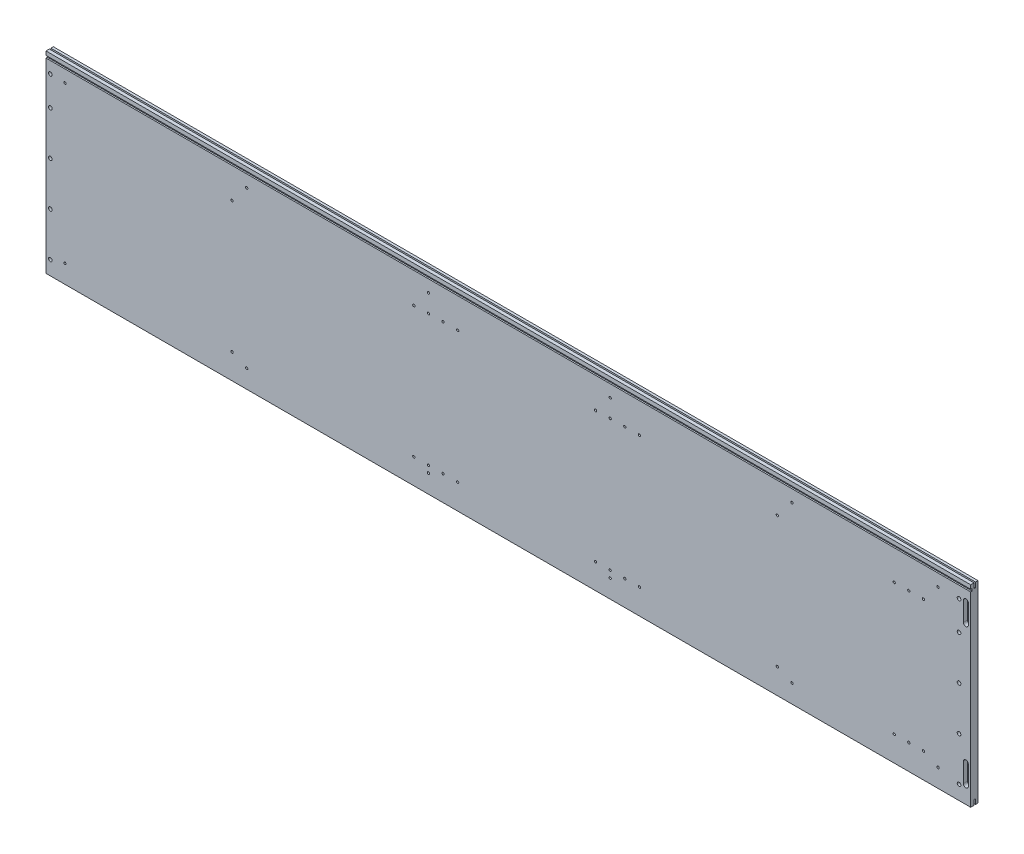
ISO-10303-21;
HEADER;
FILE_DESCRIPTION(('STEP AP214'),'2;1');
FILE_NAME('part.step','',(''),(''),'','','');
FILE_SCHEMA(('AUTOMOTIVE_DESIGN { 1 0 10303 214 1 1 1 1 }'));
ENDSEC;
DATA;
#1=APPLICATION_CONTEXT('core data for automotive mechanical design processes');
#2=APPLICATION_PROTOCOL_DEFINITION('international standard','automotive_design',2000,#1);
#3=PRODUCT_CONTEXT('',#1,'mechanical');
#4=PRODUCT('Part','Part','',(#3));
#5=PRODUCT_RELATED_PRODUCT_CATEGORY('part','',(#4));
#6=PRODUCT_DEFINITION_FORMATION('','',#4);
#7=PRODUCT_DEFINITION_CONTEXT('part definition',#1,'design');
#8=PRODUCT_DEFINITION('design','',#6,#7);
#9=PRODUCT_DEFINITION_SHAPE('','',#8);
#10=(LENGTH_UNIT() NAMED_UNIT(*) SI_UNIT(.MILLI.,.METRE.));
#11=(NAMED_UNIT(*) PLANE_ANGLE_UNIT() SI_UNIT($,.RADIAN.));
#12=(NAMED_UNIT(*) SI_UNIT($,.STERADIAN.) SOLID_ANGLE_UNIT());
#13=UNCERTAINTY_MEASURE_WITH_UNIT(LENGTH_MEASURE(1.E-05),#10,'distance_accuracy_value','');
#14=(GEOMETRIC_REPRESENTATION_CONTEXT(3) GLOBAL_UNCERTAINTY_ASSIGNED_CONTEXT((#13)) GLOBAL_UNIT_ASSIGNED_CONTEXT((#10,
#11,#12)) REPRESENTATION_CONTEXT('',''));
#15=CARTESIAN_POINT('',(0.,0.,0.));
#16=DIRECTION('',(0.,0.,1.));
#17=DIRECTION('',(1.,0.,0.));
#18=AXIS2_PLACEMENT_3D('',#15,#16,#17);
#19=CARTESIAN_POINT('',(0.,0.,16.));
#20=DIRECTION('',(0.,0.,-1.));
#21=DIRECTION('',(-1.,0.,0.));
#22=AXIS2_PLACEMENT_3D('',#19,#20,#21);
#23=PLANE('',#22);
#24=CARTESIAN_POINT('',(909.,132.,16.));
#25=DIRECTION('',(0.,0.,1.));
#26=DIRECTION('',(1.,0.,0.));
#27=AXIS2_PLACEMENT_3D('',#24,#25,#26);
#28=CIRCLE('',#27,2.49999999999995);
#29=CARTESIAN_POINT('',(911.5,132.,16.));
#30=VERTEX_POINT('',#29);
#31=EDGE_CURVE('E369',#30,#30,#28,.T.);
#32=ORIENTED_EDGE('',*,*,#31,.F.);
#33=EDGE_LOOP('',(#32));
#34=FACE_BOUND('',#33,.T.);
#35=CARTESIAN_POINT('',(877.,132.,16.));
#36=DIRECTION('',(0.,0.,1.));
#37=DIRECTION('',(1.,0.,0.));
#38=AXIS2_PLACEMENT_3D('',#35,#36,#37);
#39=CIRCLE('',#38,2.49999999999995);
#40=CARTESIAN_POINT('',(879.5,132.,16.));
#41=VERTEX_POINT('',#40);
#42=EDGE_CURVE('E368',#41,#41,#39,.T.);
#43=ORIENTED_EDGE('',*,*,#42,.F.);
#44=EDGE_LOOP('',(#43));
#45=FACE_BOUND('',#44,.T.);
#46=CARTESIAN_POINT('',(845.,132.,16.));
#47=DIRECTION('',(0.,0.,1.));
#48=DIRECTION('',(1.,0.,0.));
#49=AXIS2_PLACEMENT_3D('',#46,#47,#48);
#50=CIRCLE('',#49,2.49999999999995);
#51=CARTESIAN_POINT('',(847.5,132.,16.));
#52=VERTEX_POINT('',#51);
#53=EDGE_CURVE('E379',#52,#52,#50,.T.);
#54=ORIENTED_EDGE('',*,*,#53,.F.);
#55=EDGE_LOOP('',(#54));
#56=FACE_BOUND('',#55,.T.);
#57=CARTESIAN_POINT('',(845.,-156.,16.));
#58=DIRECTION('',(0.,0.,1.));
#59=DIRECTION('',(1.,0.,0.));
#60=AXIS2_PLACEMENT_3D('',#57,#58,#59);
#61=CIRCLE('',#60,2.49999999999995);
#62=CARTESIAN_POINT('',(847.5,-156.,16.));
#63=VERTEX_POINT('',#62);
#64=EDGE_CURVE('E385',#63,#63,#61,.T.);
#65=ORIENTED_EDGE('',*,*,#64,.F.);
#66=EDGE_LOOP('',(#65));
#67=FACE_BOUND('',#66,.T.);
#68=CARTESIAN_POINT('',(909.,-156.,16.));
#69=DIRECTION('',(0.,0.,1.));
#70=DIRECTION('',(1.,0.,0.));
#71=AXIS2_PLACEMENT_3D('',#68,#69,#70);
#72=CIRCLE('',#71,2.49999999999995);
#73=CARTESIAN_POINT('',(911.5,-156.,16.));
#74=VERTEX_POINT('',#73);
#75=EDGE_CURVE('E397',#74,#74,#72,.T.);
#76=ORIENTED_EDGE('',*,*,#75,.F.);
#77=EDGE_LOOP('',(#76));
#78=FACE_BOUND('',#77,.T.);
#79=CARTESIAN_POINT('',(-175.,132.,16.));
#80=DIRECTION('',(0.,0.,1.));
#81=DIRECTION('',(1.,0.,0.));
#82=AXIS2_PLACEMENT_3D('',#79,#80,#81);
#83=CIRCLE('',#82,2.5);
#84=CARTESIAN_POINT('',(-172.5,132.,16.));
#85=VERTEX_POINT('',#84);
#86=EDGE_CURVE('E403',#85,#85,#83,.T.);
#87=ORIENTED_EDGE('',*,*,#86,.F.);
#88=EDGE_LOOP('',(#87));
#89=FACE_BOUND('',#88,.T.);
#90=CARTESIAN_POINT('',(-143.,132.,16.));
#91=DIRECTION('',(0.,0.,1.));
#92=DIRECTION('',(1.,0.,0.));
#93=AXIS2_PLACEMENT_3D('',#90,#91,#92);
#94=CIRCLE('',#93,2.5);
#95=CARTESIAN_POINT('',(-140.5,132.,16.));
#96=VERTEX_POINT('',#95);
#97=EDGE_CURVE('E409',#96,#96,#94,.T.);
#98=ORIENTED_EDGE('',*,*,#97,.F.);
#99=EDGE_LOOP('',(#98));
#100=FACE_BOUND('',#99,.T.);
#101=CARTESIAN_POINT('',(-111.,132.,16.));
#102=DIRECTION('',(0.,0.,1.));
#103=DIRECTION('',(1.,0.,0.));
#104=AXIS2_PLACEMENT_3D('',#101,#102,#103);
#105=CIRCLE('',#104,2.5);
#106=CARTESIAN_POINT('',(-108.5,132.,16.));
#107=VERTEX_POINT('',#106);
#108=EDGE_CURVE('E415',#107,#107,#105,.T.);
#109=ORIENTED_EDGE('',*,*,#108,.F.);
#110=EDGE_LOOP('',(#109));
#111=FACE_BOUND('',#110,.T.);
#112=CARTESIAN_POINT('',(287.,132.,16.));
#113=DIRECTION('',(0.,0.,1.));
#114=DIRECTION('',(1.,0.,0.));
#115=AXIS2_PLACEMENT_3D('',#112,#113,#114);
#116=CIRCLE('',#115,2.5);
#117=CARTESIAN_POINT('',(289.5,132.,16.));
#118=VERTEX_POINT('',#117);
#119=EDGE_CURVE('E451',#118,#118,#116,.T.);
#120=ORIENTED_EDGE('',*,*,#119,.F.);
#121=EDGE_LOOP('',(#120));
#122=FACE_BOUND('',#121,.T.);
#123=CARTESIAN_POINT('',(287.,-156.,16.));
#124=DIRECTION('',(0.,0.,1.));
#125=DIRECTION('',(1.,0.,0.));
#126=AXIS2_PLACEMENT_3D('',#123,#124,#125);
#127=CIRCLE('',#126,2.5);
#128=CARTESIAN_POINT('',(289.5,-156.,16.));
#129=VERTEX_POINT('',#128);
#130=EDGE_CURVE('E457',#129,#129,#127,.T.);
#131=ORIENTED_EDGE('',*,*,#130,.F.);
#132=EDGE_LOOP('',(#131));
#133=FACE_BOUND('',#132,.T.);
#134=CARTESIAN_POINT('',(255.,-156.,16.));
#135=DIRECTION('',(0.,0.,1.));
#136=DIRECTION('',(1.,0.,0.));
#137=AXIS2_PLACEMENT_3D('',#134,#135,#136);
#138=CIRCLE('',#137,2.5);
#139=CARTESIAN_POINT('',(257.5,-156.,16.));
#140=VERTEX_POINT('',#139);
#141=EDGE_CURVE('E463',#140,#140,#138,.T.);
#142=ORIENTED_EDGE('',*,*,#141,.F.);
#143=EDGE_LOOP('',(#142));
#144=FACE_BOUND('',#143,.T.);
#145=CARTESIAN_POINT('',(941.,171.,16.));
#146=DIRECTION('',(0.,0.,1.));
#147=DIRECTION('',(1.,0.,0.));
#148=AXIS2_PLACEMENT_3D('',#145,#146,#147);
#149=CIRCLE('',#148,2.49999999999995);
#150=CARTESIAN_POINT('',(943.5,171.,16.));
#151=VERTEX_POINT('',#150);
#152=EDGE_CURVE('E547',#151,#151,#149,.T.);
#153=ORIENTED_EDGE('',*,*,#152,.F.);
#154=EDGE_LOOP('',(#153));
#155=FACE_BOUND('',#154,.T.);
#156=CARTESIAN_POINT('',(223.,171.,16.));
#157=DIRECTION('',(0.,0.,1.));
#158=DIRECTION('',(1.,0.,0.));
#159=AXIS2_PLACEMENT_3D('',#156,#157,#158);
#160=CIRCLE('',#159,2.5);
#161=CARTESIAN_POINT('',(225.5,171.,16.));
#162=VERTEX_POINT('',#161);
#163=EDGE_CURVE('E559',#162,#162,#160,.T.);
#164=ORIENTED_EDGE('',*,*,#163,.F.);
#165=EDGE_LOOP('',(#164));
#166=FACE_BOUND('',#165,.T.);
#167=CARTESIAN_POINT('',(-175.,171.,16.));
#168=DIRECTION('',(0.,0.,1.));
#169=DIRECTION('',(1.,0.,0.));
#170=AXIS2_PLACEMENT_3D('',#167,#168,#169);
#171=CIRCLE('',#170,2.5);
#172=CARTESIAN_POINT('',(-172.5,171.,16.));
#173=VERTEX_POINT('',#172);
#174=EDGE_CURVE('E565',#173,#173,#171,.T.);
#175=ORIENTED_EDGE('',*,*,#174,.F.);
#176=EDGE_LOOP('',(#175));
#177=FACE_BOUND('',#176,.T.);
#178=CARTESIAN_POINT('',(-971.,171.,16.));
#179=DIRECTION('',(0.,0.,1.));
#180=DIRECTION('',(1.,0.,0.));
#181=AXIS2_PLACEMENT_3D('',#178,#179,#180);
#182=CIRCLE('',#181,2.49999999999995);
#183=CARTESIAN_POINT('',(-968.5,171.,16.));
#184=VERTEX_POINT('',#183);
#185=EDGE_CURVE('E577',#184,#184,#182,.T.);
#186=ORIENTED_EDGE('',*,*,#185,.F.);
#187=EDGE_LOOP('',(#186));
#188=FACE_BOUND('',#187,.T.);
#189=CARTESIAN_POINT('',(-971.,-171.,16.));
#190=DIRECTION('',(0.,0.,1.));
#191=DIRECTION('',(1.,0.,0.));
#192=AXIS2_PLACEMENT_3D('',#189,#190,#191);
#193=CIRCLE('',#192,2.49999999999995);
#194=CARTESIAN_POINT('',(-968.5,-171.,16.));
#195=VERTEX_POINT('',#194);
#196=EDGE_CURVE('E583',#195,#195,#193,.T.);
#197=ORIENTED_EDGE('',*,*,#196,.F.);
#198=EDGE_LOOP('',(#197));
#199=FACE_BOUND('',#198,.T.);
#200=CARTESIAN_POINT('',(-175.,-171.,16.));
#201=DIRECTION('',(0.,0.,1.));
#202=DIRECTION('',(1.,0.,0.));
#203=AXIS2_PLACEMENT_3D('',#200,#201,#202);
#204=CIRCLE('',#203,2.5);
#205=CARTESIAN_POINT('',(-172.5,-171.,16.));
#206=VERTEX_POINT('',#205);
#207=EDGE_CURVE('E595',#206,#206,#204,.T.);
#208=ORIENTED_EDGE('',*,*,#207,.F.);
#209=EDGE_LOOP('',(#208));
#210=FACE_BOUND('',#209,.T.);
#211=CARTESIAN_POINT('',(223.,-171.,16.));
#212=DIRECTION('',(0.,0.,1.));
#213=DIRECTION('',(1.,0.,0.));
#214=AXIS2_PLACEMENT_3D('',#211,#212,#213);
#215=CIRCLE('',#214,2.5);
#216=CARTESIAN_POINT('',(225.5,-171.,16.));
#217=VERTEX_POINT('',#216);
#218=EDGE_CURVE('E601',#217,#217,#215,.T.);
#219=ORIENTED_EDGE('',*,*,#218,.F.);
#220=EDGE_LOOP('',(#219));
#221=FACE_BOUND('',#220,.T.);
#222=CARTESIAN_POINT('',(621.,-171.,16.));
#223=DIRECTION('',(0.,0.,1.));
#224=DIRECTION('',(1.,0.,0.));
#225=AXIS2_PLACEMENT_3D('',#222,#223,#224);
#226=CIRCLE('',#225,2.49999999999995);
#227=CARTESIAN_POINT('',(623.5,-171.,16.));
#228=VERTEX_POINT('',#227);
#229=EDGE_CURVE('E607',#228,#228,#226,.T.);
#230=ORIENTED_EDGE('',*,*,#229,.F.);
#231=EDGE_LOOP('',(#230));
#232=FACE_BOUND('',#231,.T.);
#233=CARTESIAN_POINT('',(941.,-171.,16.));
#234=DIRECTION('',(0.,0.,1.));
#235=DIRECTION('',(1.,0.,0.));
#236=AXIS2_PLACEMENT_3D('',#233,#234,#235);
#237=CIRCLE('',#236,2.49999999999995);
#238=CARTESIAN_POINT('',(943.5,-171.,16.));
#239=VERTEX_POINT('',#238);
#240=EDGE_CURVE('E613',#239,#239,#237,.T.);
#241=ORIENTED_EDGE('',*,*,#240,.F.);
#242=EDGE_LOOP('',(#241));
#243=FACE_BOUND('',#242,.T.);
#244=CARTESIAN_POINT('',(589.,131.,16.));
#245=DIRECTION('',(0.,0.,1.));
#246=DIRECTION('',(1.,0.,0.));
#247=AXIS2_PLACEMENT_3D('',#244,#245,#246);
#248=CIRCLE('',#247,2.49999999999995);
#249=CARTESIAN_POINT('',(591.5,131.,16.));
#250=VERTEX_POINT('',#249);
#251=EDGE_CURVE('E619',#250,#250,#248,.T.);
#252=ORIENTED_EDGE('',*,*,#251,.F.);
#253=EDGE_LOOP('',(#252));
#254=FACE_BOUND('',#253,.T.);
#255=CARTESIAN_POINT('',(191.,131.,16.));
#256=DIRECTION('',(0.,0.,1.));
#257=DIRECTION('',(1.,0.,0.));
#258=AXIS2_PLACEMENT_3D('',#255,#256,#257);
#259=CIRCLE('',#258,2.5);
#260=CARTESIAN_POINT('',(193.5,131.,16.));
#261=VERTEX_POINT('',#260);
#262=EDGE_CURVE('E625',#261,#261,#259,.T.);
#263=ORIENTED_EDGE('',*,*,#262,.F.);
#264=EDGE_LOOP('',(#263));
#265=FACE_BOUND('',#264,.T.);
#266=CARTESIAN_POINT('',(-207.,131.,16.));
#267=DIRECTION('',(0.,0.,1.));
#268=DIRECTION('',(1.,0.,0.));
#269=AXIS2_PLACEMENT_3D('',#266,#267,#268);
#270=CIRCLE('',#269,2.5);
#271=CARTESIAN_POINT('',(-204.5,131.,16.));
#272=VERTEX_POINT('',#271);
#273=EDGE_CURVE('E631',#272,#272,#270,.T.);
#274=ORIENTED_EDGE('',*,*,#273,.F.);
#275=EDGE_LOOP('',(#274));
#276=FACE_BOUND('',#275,.T.);
#277=CARTESIAN_POINT('',(-207.,-156.,16.));
#278=DIRECTION('',(0.,0.,1.));
#279=DIRECTION('',(1.,0.,0.));
#280=AXIS2_PLACEMENT_3D('',#277,#278,#279);
#281=CIRCLE('',#280,2.5);
#282=CARTESIAN_POINT('',(-204.5,-156.,16.));
#283=VERTEX_POINT('',#282);
#284=EDGE_CURVE('E637',#283,#283,#281,.T.);
#285=ORIENTED_EDGE('',*,*,#284,.F.);
#286=EDGE_LOOP('',(#285));
#287=FACE_BOUND('',#286,.T.);
#288=CARTESIAN_POINT('',(191.,-156.,16.));
#289=DIRECTION('',(0.,0.,1.));
#290=DIRECTION('',(1.,0.,0.));
#291=AXIS2_PLACEMENT_3D('',#288,#289,#290);
#292=CIRCLE('',#291,2.5);
#293=CARTESIAN_POINT('',(193.5,-156.,16.));
#294=VERTEX_POINT('',#293);
#295=EDGE_CURVE('E643',#294,#294,#292,.T.);
#296=ORIENTED_EDGE('',*,*,#295,.F.);
#297=EDGE_LOOP('',(#296));
#298=FACE_BOUND('',#297,.T.);
#299=CARTESIAN_POINT('',(589.,-156.,16.));
#300=DIRECTION('',(0.,0.,1.));
#301=DIRECTION('',(1.,0.,0.));
#302=AXIS2_PLACEMENT_3D('',#299,#300,#301);
#303=CIRCLE('',#302,2.49999999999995);
#304=CARTESIAN_POINT('',(591.5,-156.,16.));
#305=VERTEX_POINT('',#304);
#306=EDGE_CURVE('E649',#305,#305,#303,.T.);
#307=ORIENTED_EDGE('',*,*,#306,.F.);
#308=EDGE_LOOP('',(#307));
#309=FACE_BOUND('',#308,.T.);
#310=CARTESIAN_POINT('',(-605.,131.,16.));
#311=DIRECTION('',(0.,0.,1.));
#312=DIRECTION('',(1.,0.,0.));
#313=AXIS2_PLACEMENT_3D('',#310,#311,#312);
#314=CIRCLE('',#313,2.49999999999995);
#315=CARTESIAN_POINT('',(-602.5,131.,16.));
#316=VERTEX_POINT('',#315);
#317=EDGE_CURVE('E655',#316,#316,#314,.T.);
#318=ORIENTED_EDGE('',*,*,#317,.F.);
#319=EDGE_LOOP('',(#318));
#320=FACE_BOUND('',#319,.T.);
#321=CARTESIAN_POINT('',(-605.,-156.,16.));
#322=DIRECTION('',(0.,0.,1.));
#323=DIRECTION('',(1.,0.,0.));
#324=AXIS2_PLACEMENT_3D('',#321,#322,#323);
#325=CIRCLE('',#324,2.49999999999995);
#326=CARTESIAN_POINT('',(-602.5,-156.,16.));
#327=VERTEX_POINT('',#326);
#328=EDGE_CURVE('E661',#327,#327,#325,.T.);
#329=ORIENTED_EDGE('',*,*,#328,.F.);
#330=EDGE_LOOP('',(#329));
#331=FACE_BOUND('',#330,.T.);
#332=DIRECTION('',(0.,-1.,0.));
#333=VECTOR('',#332,1.);
#334=CARTESIAN_POINT('',(996.5,-131.8,16.));
#335=LINE('',#334,#333);
#336=CARTESIAN_POINT('',(996.5,-131.8,16.));
#337=VERTEX_POINT('',#336);
#338=CARTESIAN_POINT('',(996.5,-174.,16.));
#339=VERTEX_POINT('',#338);
#340=EDGE_CURVE('E683',#337,#339,#335,.T.);
#341=ORIENTED_EDGE('',*,*,#340,.F.);
#342=CARTESIAN_POINT('',(1001.9,-131.8,16.));
#343=DIRECTION('',(0.,0.,1.));
#344=DIRECTION('',(1.,0.,0.));
#345=AXIS2_PLACEMENT_3D('',#342,#343,#344);
#346=CIRCLE('',#345,5.39999999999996);
#347=CARTESIAN_POINT('',(1007.3,-131.8,16.));
#348=VERTEX_POINT('',#347);
#349=EDGE_CURVE('E667',#348,#337,#346,.T.);
#350=ORIENTED_EDGE('',*,*,#349,.F.);
#351=DIRECTION('',(0.,1.,0.));
#352=VECTOR('',#351,1.);
#353=CARTESIAN_POINT('',(1007.3,-131.8,16.));
#354=LINE('',#353,#352);
#355=CARTESIAN_POINT('',(1007.3,-174.,16.));
#356=VERTEX_POINT('',#355);
#357=EDGE_CURVE('E672',#356,#348,#354,.T.);
#358=ORIENTED_EDGE('',*,*,#357,.F.);
#359=CARTESIAN_POINT('',(1001.9,-174.,16.));
#360=DIRECTION('',(0.,0.,1.));
#361=DIRECTION('',(1.,0.,0.));
#362=AXIS2_PLACEMENT_3D('',#359,#360,#361);
#363=CIRCLE('',#362,5.39999999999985);
#364=EDGE_CURVE('E686',#339,#356,#363,.T.);
#365=ORIENTED_EDGE('',*,*,#364,.F.);
#366=EDGE_LOOP('',(#341,#350,#358,#365));
#367=FACE_BOUND('',#366,.T.);
#368=DIRECTION('',(0.,-1.,0.));
#369=VECTOR('',#368,1.);
#370=CARTESIAN_POINT('',(996.5,174.,16.));
#371=LINE('',#370,#369);
#372=CARTESIAN_POINT('',(996.5,174.,16.));
#373=VERTEX_POINT('',#372);
#374=CARTESIAN_POINT('',(996.5,131.8,16.));
#375=VERTEX_POINT('',#374);
#376=EDGE_CURVE('E715',#373,#375,#371,.T.);
#377=ORIENTED_EDGE('',*,*,#376,.F.);
#378=CARTESIAN_POINT('',(1001.9,174.,16.));
#379=DIRECTION('',(0.,0.,1.));
#380=DIRECTION('',(1.,0.,0.));
#381=AXIS2_PLACEMENT_3D('',#378,#379,#380);
#382=CIRCLE('',#381,5.39999999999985);
#383=CARTESIAN_POINT('',(1007.3,174.,16.));
#384=VERTEX_POINT('',#383);
#385=EDGE_CURVE('E693',#384,#373,#382,.T.);
#386=ORIENTED_EDGE('',*,*,#385,.F.);
#387=DIRECTION('',(0.,1.,0.));
#388=VECTOR('',#387,1.);
#389=CARTESIAN_POINT('',(1007.3,174.,16.));
#390=LINE('',#389,#388);
#391=CARTESIAN_POINT('',(1007.3,131.8,16.));
#392=VERTEX_POINT('',#391);
#393=EDGE_CURVE('E704',#392,#384,#390,.T.);
#394=ORIENTED_EDGE('',*,*,#393,.F.);
#395=CARTESIAN_POINT('',(1001.9,131.8,16.));
#396=DIRECTION('',(0.,0.,1.));
#397=DIRECTION('',(1.,0.,0.));
#398=AXIS2_PLACEMENT_3D('',#395,#396,#397);
#399=CIRCLE('',#398,5.40000000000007);
#400=EDGE_CURVE('E718',#375,#392,#399,.T.);
#401=ORIENTED_EDGE('',*,*,#400,.F.);
#402=EDGE_LOOP('',(#377,#386,#394,#401));
#403=FACE_BOUND('',#402,.T.);
#404=CARTESIAN_POINT('',(-1003.,-180.,16.));
#405=DIRECTION('',(0.,0.,1.));
#406=DIRECTION('',(1.,0.,0.));
#407=AXIS2_PLACEMENT_3D('',#404,#405,#406);
#408=CIRCLE('',#407,4.);
#409=CARTESIAN_POINT('',(-999.,-180.,16.));
#410=VERTEX_POINT('',#409);
#411=EDGE_CURVE('E851',#410,#410,#408,.T.);
#412=ORIENTED_EDGE('',*,*,#411,.F.);
#413=EDGE_LOOP('',(#412));
#414=FACE_BOUND('',#413,.T.);
#415=CARTESIAN_POINT('',(-1003.,-84.0000000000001,16.));
#416=DIRECTION('',(0.,0.,1.));
#417=DIRECTION('',(1.,0.,0.));
#418=AXIS2_PLACEMENT_3D('',#415,#416,#417);
#419=CIRCLE('',#418,4.);
#420=CARTESIAN_POINT('',(-999.,-84.0000000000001,16.));
#421=VERTEX_POINT('',#420);
#422=EDGE_CURVE('E845',#421,#421,#419,.T.);
#423=ORIENTED_EDGE('',*,*,#422,.F.);
#424=EDGE_LOOP('',(#423));
#425=FACE_BOUND('',#424,.T.);
#426=CARTESIAN_POINT('',(-1003.,11.9999999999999,16.));
#427=DIRECTION('',(0.,0.,1.));
#428=DIRECTION('',(1.,0.,0.));
#429=AXIS2_PLACEMENT_3D('',#426,#427,#428);
#430=CIRCLE('',#429,4.);
#431=CARTESIAN_POINT('',(-999.,11.9999999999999,16.));
#432=VERTEX_POINT('',#431);
#433=EDGE_CURVE('E839',#432,#432,#430,.T.);
#434=ORIENTED_EDGE('',*,*,#433,.F.);
#435=EDGE_LOOP('',(#434));
#436=FACE_BOUND('',#435,.T.);
#437=CARTESIAN_POINT('',(-1003.,108.,16.));
#438=DIRECTION('',(0.,0.,1.));
#439=DIRECTION('',(1.,0.,0.));
#440=AXIS2_PLACEMENT_3D('',#437,#438,#439);
#441=CIRCLE('',#440,4.);
#442=CARTESIAN_POINT('',(-999.,108.,16.));
#443=VERTEX_POINT('',#442);
#444=EDGE_CURVE('E833',#443,#443,#441,.T.);
#445=ORIENTED_EDGE('',*,*,#444,.F.);
#446=EDGE_LOOP('',(#445));
#447=FACE_BOUND('',#446,.T.);
#448=CARTESIAN_POINT('',(-1003.,172.,16.));
#449=DIRECTION('',(0.,0.,1.));
#450=DIRECTION('',(1.,0.,0.));
#451=AXIS2_PLACEMENT_3D('',#448,#449,#450);
#452=CIRCLE('',#451,4.);
#453=CARTESIAN_POINT('',(-999.,172.,16.));
#454=VERTEX_POINT('',#453);
#455=EDGE_CURVE('E827',#454,#454,#452,.T.);
#456=ORIENTED_EDGE('',*,*,#455,.F.);
#457=EDGE_LOOP('',(#456));
#458=FACE_BOUND('',#457,.T.);
#459=CARTESIAN_POINT('',(987.,-180.,16.));
#460=DIRECTION('',(0.,0.,1.));
#461=DIRECTION('',(1.,0.,0.));
#462=AXIS2_PLACEMENT_3D('',#459,#460,#461);
#463=CIRCLE('',#462,4.);
#464=CARTESIAN_POINT('',(991.,-180.,16.));
#465=VERTEX_POINT('',#464);
#466=EDGE_CURVE('E821',#465,#465,#463,.T.);
#467=ORIENTED_EDGE('',*,*,#466,.F.);
#468=EDGE_LOOP('',(#467));
#469=FACE_BOUND('',#468,.T.);
#470=CARTESIAN_POINT('',(987.,-84.0000000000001,16.));
#471=DIRECTION('',(0.,0.,1.));
#472=DIRECTION('',(1.,0.,0.));
#473=AXIS2_PLACEMENT_3D('',#470,#471,#472);
#474=CIRCLE('',#473,4.);
#475=CARTESIAN_POINT('',(991.,-84.0000000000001,16.));
#476=VERTEX_POINT('',#475);
#477=EDGE_CURVE('E815',#476,#476,#474,.T.);
#478=ORIENTED_EDGE('',*,*,#477,.F.);
#479=EDGE_LOOP('',(#478));
#480=FACE_BOUND('',#479,.T.);
#481=CARTESIAN_POINT('',(987.,11.9999999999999,16.));
#482=DIRECTION('',(0.,0.,1.));
#483=DIRECTION('',(1.,0.,0.));
#484=AXIS2_PLACEMENT_3D('',#481,#482,#483);
#485=CIRCLE('',#484,4.);
#486=CARTESIAN_POINT('',(991.,11.9999999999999,16.));
#487=VERTEX_POINT('',#486);
#488=EDGE_CURVE('E809',#487,#487,#485,.T.);
#489=ORIENTED_EDGE('',*,*,#488,.F.);
#490=EDGE_LOOP('',(#489));
#491=FACE_BOUND('',#490,.T.);
#492=CARTESIAN_POINT('',(987.,108.,16.));
#493=DIRECTION('',(0.,0.,1.));
#494=DIRECTION('',(1.,0.,0.));
#495=AXIS2_PLACEMENT_3D('',#492,#493,#494);
#496=CIRCLE('',#495,4.);
#497=CARTESIAN_POINT('',(991.,108.,16.));
#498=VERTEX_POINT('',#497);
#499=EDGE_CURVE('E803',#498,#498,#496,.T.);
#500=ORIENTED_EDGE('',*,*,#499,.F.);
#501=EDGE_LOOP('',(#500));
#502=FACE_BOUND('',#501,.T.);
#503=CARTESIAN_POINT('',(987.,172.,16.));
#504=DIRECTION('',(0.,0.,1.));
#505=DIRECTION('',(1.,0.,0.));
#506=AXIS2_PLACEMENT_3D('',#503,#504,#505);
#507=CIRCLE('',#506,4.);
#508=CARTESIAN_POINT('',(991.,172.,16.));
#509=VERTEX_POINT('',#508);
#510=EDGE_CURVE('E792',#509,#509,#507,.T.);
#511=ORIENTED_EDGE('',*,*,#510,.F.);
#512=EDGE_LOOP('',(#511));
#513=FACE_BOUND('',#512,.T.);
#514=DIRECTION('',(0.,1.,0.));
#515=VECTOR('',#514,1.);
#516=CARTESIAN_POINT('',(1012.5,-211.,16.));
#517=LINE('',#516,#515);
#518=CARTESIAN_POINT('',(1012.5,-211.,16.));
#519=VERTEX_POINT('',#518);
#520=CARTESIAN_POINT('',(1012.5,197.5,16.));
#521=VERTEX_POINT('',#520);
#522=EDGE_CURVE('E858',#519,#521,#517,.T.);
#523=ORIENTED_EDGE('',*,*,#522,.T.);
#524=DIRECTION('',(-1.,0.,0.));
#525=VECTOR('',#524,1.);
#526=CARTESIAN_POINT('',(1012.5,197.5,16.));
#527=LINE('',#526,#525);
#528=CARTESIAN_POINT('',(-1012.5,197.5,16.));
#529=VERTEX_POINT('',#528);
#530=EDGE_CURVE('E789',#521,#529,#527,.T.);
#531=ORIENTED_EDGE('',*,*,#530,.T.);
#532=DIRECTION('',(0.,-1.,0.));
#533=VECTOR('',#532,1.);
#534=CARTESIAN_POINT('',(-1012.5,-211.,16.));
#535=LINE('',#534,#533);
#536=CARTESIAN_POINT('',(-1012.5,-211.,16.));
#537=VERTEX_POINT('',#536);
#538=EDGE_CURVE('E864',#529,#537,#535,.T.);
#539=ORIENTED_EDGE('',*,*,#538,.T.);
#540=DIRECTION('',(1.,0.,0.));
#541=VECTOR('',#540,1.);
#542=CARTESIAN_POINT('',(-1012.5,-211.,16.));
#543=LINE('',#542,#541);
#544=EDGE_CURVE('E868',#537,#519,#543,.T.);
#545=ORIENTED_EDGE('',*,*,#544,.T.);
#546=EDGE_LOOP('',(#523,#531,#539,#545));
#547=FACE_BOUND('',#546,.T.);
#548=CARTESIAN_POINT('',(-573.,-171.,16.));
#549=DIRECTION('',(0.,0.,1.));
#550=DIRECTION('',(1.,0.,0.));
#551=AXIS2_PLACEMENT_3D('',#548,#549,#550);
#552=CIRCLE('',#551,2.49999999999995);
#553=CARTESIAN_POINT('',(-570.5,-171.,16.));
#554=VERTEX_POINT('',#553);
#555=EDGE_CURVE('E589',#554,#554,#552,.T.);
#556=ORIENTED_EDGE('',*,*,#555,.F.);
#557=EDGE_LOOP('',(#556));
#558=FACE_BOUND('',#557,.T.);
#559=CARTESIAN_POINT('',(-573.,171.,16.));
#560=DIRECTION('',(0.,0.,1.));
#561=DIRECTION('',(1.,0.,0.));
#562=AXIS2_PLACEMENT_3D('',#559,#560,#561);
#563=CIRCLE('',#562,2.49999999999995);
#564=CARTESIAN_POINT('',(-570.5,171.,16.));
#565=VERTEX_POINT('',#564);
#566=EDGE_CURVE('E571',#565,#565,#563,.T.);
#567=ORIENTED_EDGE('',*,*,#566,.F.);
#568=EDGE_LOOP('',(#567));
#569=FACE_BOUND('',#568,.T.);
#570=CARTESIAN_POINT('',(621.,171.,16.));
#571=DIRECTION('',(0.,0.,1.));
#572=DIRECTION('',(1.,0.,0.));
#573=AXIS2_PLACEMENT_3D('',#570,#571,#572);
#574=CIRCLE('',#573,2.49999999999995);
#575=CARTESIAN_POINT('',(623.5,171.,16.));
#576=VERTEX_POINT('',#575);
#577=EDGE_CURVE('E553',#576,#576,#574,.T.);
#578=ORIENTED_EDGE('',*,*,#577,.F.);
#579=EDGE_LOOP('',(#578));
#580=FACE_BOUND('',#579,.T.);
#581=CARTESIAN_POINT('',(223.,-156.,16.));
#582=DIRECTION('',(0.,0.,1.));
#583=DIRECTION('',(1.,0.,0.));
#584=AXIS2_PLACEMENT_3D('',#581,#582,#583);
#585=CIRCLE('',#584,2.5);
#586=CARTESIAN_POINT('',(225.5,-156.,16.));
#587=VERTEX_POINT('',#586);
#588=EDGE_CURVE('E469',#587,#587,#585,.T.);
#589=ORIENTED_EDGE('',*,*,#588,.F.);
#590=EDGE_LOOP('',(#589));
#591=FACE_BOUND('',#590,.T.);
#592=CARTESIAN_POINT('',(255.,132.,16.));
#593=DIRECTION('',(0.,0.,1.));
#594=DIRECTION('',(1.,0.,0.));
#595=AXIS2_PLACEMENT_3D('',#592,#593,#594);
#596=CIRCLE('',#595,2.5);
#597=CARTESIAN_POINT('',(257.5,132.,16.));
#598=VERTEX_POINT('',#597);
#599=EDGE_CURVE('E445',#598,#598,#596,.T.);
#600=ORIENTED_EDGE('',*,*,#599,.F.);
#601=EDGE_LOOP('',(#600));
#602=FACE_BOUND('',#601,.T.);
#603=CARTESIAN_POINT('',(223.,132.,16.));
#604=DIRECTION('',(0.,0.,1.));
#605=DIRECTION('',(1.,0.,0.));
#606=AXIS2_PLACEMENT_3D('',#603,#604,#605);
#607=CIRCLE('',#606,2.5);
#608=CARTESIAN_POINT('',(225.5,132.,16.));
#609=VERTEX_POINT('',#608);
#610=EDGE_CURVE('E439',#609,#609,#607,.T.);
#611=ORIENTED_EDGE('',*,*,#610,.F.);
#612=EDGE_LOOP('',(#611));
#613=FACE_BOUND('',#612,.T.);
#614=CARTESIAN_POINT('',(-175.,-156.,16.));
#615=DIRECTION('',(0.,0.,1.));
#616=DIRECTION('',(1.,0.,0.));
#617=AXIS2_PLACEMENT_3D('',#614,#615,#616);
#618=CIRCLE('',#617,2.5);
#619=CARTESIAN_POINT('',(-172.5,-156.,16.));
#620=VERTEX_POINT('',#619);
#621=EDGE_CURVE('E433',#620,#620,#618,.T.);
#622=ORIENTED_EDGE('',*,*,#621,.F.);
#623=EDGE_LOOP('',(#622));
#624=FACE_BOUND('',#623,.T.);
#625=CARTESIAN_POINT('',(-143.,-156.,16.));
#626=DIRECTION('',(0.,0.,1.));
#627=DIRECTION('',(1.,0.,0.));
#628=AXIS2_PLACEMENT_3D('',#625,#626,#627);
#629=CIRCLE('',#628,2.5);
#630=CARTESIAN_POINT('',(-140.5,-156.,16.));
#631=VERTEX_POINT('',#630);
#632=EDGE_CURVE('E427',#631,#631,#629,.T.);
#633=ORIENTED_EDGE('',*,*,#632,.F.);
#634=EDGE_LOOP('',(#633));
#635=FACE_BOUND('',#634,.T.);
#636=CARTESIAN_POINT('',(-111.,-156.,16.));
#637=DIRECTION('',(0.,0.,1.));
#638=DIRECTION('',(1.,0.,0.));
#639=AXIS2_PLACEMENT_3D('',#636,#637,#638);
#640=CIRCLE('',#639,2.5);
#641=CARTESIAN_POINT('',(-108.5,-156.,16.));
#642=VERTEX_POINT('',#641);
#643=EDGE_CURVE('E421',#642,#642,#640,.T.);
#644=ORIENTED_EDGE('',*,*,#643,.F.);
#645=EDGE_LOOP('',(#644));
#646=FACE_BOUND('',#645,.T.);
#647=CARTESIAN_POINT('',(877.,-156.,16.));
#648=DIRECTION('',(0.,0.,1.));
#649=DIRECTION('',(1.,0.,0.));
#650=AXIS2_PLACEMENT_3D('',#647,#648,#649);
#651=CIRCLE('',#650,2.49999999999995);
#652=CARTESIAN_POINT('',(879.5,-156.,16.));
#653=VERTEX_POINT('',#652);
#654=EDGE_CURVE('E391',#653,#653,#651,.T.);
#655=ORIENTED_EDGE('',*,*,#654,.F.);
#656=EDGE_LOOP('',(#655));
#657=FACE_BOUND('',#656,.T.);
#658=ADVANCED_FACE('F32',(#34,#45,#56,#67,#78,#89,#100,#111,#122,#133,#144,#155,#166,#177,#188,
#199,#210,#221,#232,#243,#254,#265,#276,#287,#298,#309,#320,#331,#367,#403,#414,#425,#436,#447,
#458,#469,#480,#491,#502,#513,#547,#558,#569,#580,#591,#602,#613,#624,#635,#646,#657),#23,.F.);
#659=CARTESIAN_POINT('',(-1012.5,-211.,16.));
#660=DIRECTION('',(1.,0.,0.));
#661=DIRECTION('',(0.,0.,-1.));
#662=AXIS2_PLACEMENT_3D('',#659,#660,#661);
#663=PLANE('',#662);
#664=DIRECTION('',(0.,-1.,0.));
#665=VECTOR('',#664,1.);
#666=CARTESIAN_POINT('',(-1012.5,211.,8.7));
#667=LINE('',#666,#665);
#668=CARTESIAN_POINT('',(-1012.5,211.,8.7));
#669=VERTEX_POINT('',#668);
#670=CARTESIAN_POINT('',(-1012.5,-211.,8.7));
#671=VERTEX_POINT('',#670);
#672=EDGE_CURVE('E750',#669,#671,#667,.T.);
#673=ORIENTED_EDGE('',*,*,#672,.T.);
#674=DIRECTION('',(0.,0.,-1.));
#675=VECTOR('',#674,1.);
#676=CARTESIAN_POINT('',(-1012.5,-211.,16.));
#677=LINE('',#676,#675);
#678=EDGE_CURVE('E886',#537,#671,#677,.T.);
#679=ORIENTED_EDGE('',*,*,#678,.F.);
#680=ORIENTED_EDGE('',*,*,#538,.F.);
#681=DIRECTION('',(0.,0.,1.));
#682=VECTOR('',#681,1.);
#683=CARTESIAN_POINT('',(-1012.5,197.5,13.));
#684=LINE('',#683,#682);
#685=CARTESIAN_POINT('',(-1012.5,197.5,13.));
#686=VERTEX_POINT('',#685);
#687=EDGE_CURVE('E776',#686,#529,#684,.T.);
#688=ORIENTED_EDGE('',*,*,#687,.F.);
#689=DIRECTION('',(0.,-1.,0.));
#690=VECTOR('',#689,1.);
#691=CARTESIAN_POINT('',(-1012.5,202.5,13.));
#692=LINE('',#691,#690);
#693=CARTESIAN_POINT('',(-1012.5,202.5,13.));
#694=VERTEX_POINT('',#693);
#695=EDGE_CURVE('E785',#694,#686,#692,.T.);
#696=ORIENTED_EDGE('',*,*,#695,.F.);
#697=DIRECTION('',(0.,0.,-1.));
#698=VECTOR('',#697,1.);
#699=CARTESIAN_POINT('',(-1012.5,202.5,16.));
#700=LINE('',#699,#698);
#701=CARTESIAN_POINT('',(-1012.5,202.5,16.));
#702=VERTEX_POINT('',#701);
#703=EDGE_CURVE('E766',#702,#694,#700,.T.);
#704=ORIENTED_EDGE('',*,*,#703,.F.);
#705=CARTESIAN_POINT('',(-1012.5,211.,16.));
#706=VERTEX_POINT('',#705);
#707=EDGE_CURVE('E865',#706,#702,#535,.T.);
#708=ORIENTED_EDGE('',*,*,#707,.F.);
#709=DIRECTION('',(0.,0.,-1.));
#710=VECTOR('',#709,1.);
#711=CARTESIAN_POINT('',(-1012.5,211.,16.));
#712=LINE('',#711,#710);
#713=EDGE_CURVE('E889',#706,#669,#712,.T.);
#714=ORIENTED_EDGE('',*,*,#713,.T.);
#715=EDGE_LOOP('',(#673,#679,#680,#688,#696,#704,#708,#714));
#716=FACE_BOUND('',#715,.T.);
#717=ADVANCED_FACE('F985',(#716),#663,.F.);
#718=CARTESIAN_POINT('',(0.,0.,0.));
#719=DIRECTION('',(0.,0.,-1.));
#720=DIRECTION('',(-1.,0.,0.));
#721=AXIS2_PLACEMENT_3D('',#718,#719,#720);
#722=PLANE('',#721);
#723=CARTESIAN_POINT('',(941.,171.,0.));
#724=DIRECTION('',(0.,0.,1.));
#725=DIRECTION('',(1.,0.,0.));
#726=AXIS2_PLACEMENT_3D('',#723,#724,#725);
#727=CIRCLE('',#726,2.49999999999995);
#728=CARTESIAN_POINT('',(943.5,171.,0.));
#729=VERTEX_POINT('',#728);
#730=EDGE_CURVE('E550',#729,#729,#727,.T.);
#731=ORIENTED_EDGE('',*,*,#730,.T.);
#732=EDGE_LOOP('',(#731));
#733=FACE_BOUND('',#732,.T.);
#734=CARTESIAN_POINT('',(621.,171.,0.));
#735=DIRECTION('',(0.,0.,1.));
#736=DIRECTION('',(1.,0.,0.));
#737=AXIS2_PLACEMENT_3D('',#734,#735,#736);
#738=CIRCLE('',#737,2.49999999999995);
#739=CARTESIAN_POINT('',(623.5,171.,0.));
#740=VERTEX_POINT('',#739);
#741=EDGE_CURVE('E556',#740,#740,#738,.T.);
#742=ORIENTED_EDGE('',*,*,#741,.T.);
#743=EDGE_LOOP('',(#742));
#744=FACE_BOUND('',#743,.T.);
#745=CARTESIAN_POINT('',(223.,171.,0.));
#746=DIRECTION('',(0.,0.,1.));
#747=DIRECTION('',(1.,0.,0.));
#748=AXIS2_PLACEMENT_3D('',#745,#746,#747);
#749=CIRCLE('',#748,2.5);
#750=CARTESIAN_POINT('',(225.5,171.,0.));
#751=VERTEX_POINT('',#750);
#752=EDGE_CURVE('E562',#751,#751,#749,.T.);
#753=ORIENTED_EDGE('',*,*,#752,.T.);
#754=EDGE_LOOP('',(#753));
#755=FACE_BOUND('',#754,.T.);
#756=CARTESIAN_POINT('',(-175.,171.,0.));
#757=DIRECTION('',(0.,0.,1.));
#758=DIRECTION('',(1.,0.,0.));
#759=AXIS2_PLACEMENT_3D('',#756,#757,#758);
#760=CIRCLE('',#759,2.5);
#761=CARTESIAN_POINT('',(-172.5,171.,0.));
#762=VERTEX_POINT('',#761);
#763=EDGE_CURVE('E568',#762,#762,#760,.T.);
#764=ORIENTED_EDGE('',*,*,#763,.T.);
#765=EDGE_LOOP('',(#764));
#766=FACE_BOUND('',#765,.T.);
#767=DIRECTION('',(0.,1.,0.));
#768=VECTOR('',#767,1.);
#769=CARTESIAN_POINT('',(1012.5,-211.,0.));
#770=LINE('',#769,#768);
#771=CARTESIAN_POINT('',(1012.5,-211.,0.));
#772=VERTEX_POINT('',#771);
#773=CARTESIAN_POINT('',(1012.5,211.,0.));
#774=VERTEX_POINT('',#773);
#775=EDGE_CURVE('E857',#772,#774,#770,.T.);
#776=ORIENTED_EDGE('',*,*,#775,.F.);
#777=DIRECTION('',(1.,0.,0.));
#778=VECTOR('',#777,1.);
#779=CARTESIAN_POINT('',(-1012.5,-211.,0.));
#780=LINE('',#779,#778);
#781=CARTESIAN_POINT('',(-1012.5,-211.,0.));
#782=VERTEX_POINT('',#781);
#783=EDGE_CURVE('E879',#782,#772,#780,.T.);
#784=ORIENTED_EDGE('',*,*,#783,.F.);
#785=DIRECTION('',(0.,-1.,0.));
#786=VECTOR('',#785,1.);
#787=CARTESIAN_POINT('',(-1012.5,-211.,0.));
#788=LINE('',#787,#786);
#789=CARTESIAN_POINT('',(-1012.5,211.,0.));
#790=VERTEX_POINT('',#789);
#791=EDGE_CURVE('E876',#790,#782,#788,.T.);
#792=ORIENTED_EDGE('',*,*,#791,.F.);
#793=DIRECTION('',(-1.,0.,0.));
#794=VECTOR('',#793,1.);
#795=CARTESIAN_POINT('',(-1012.5,211.,0.));
#796=LINE('',#795,#794);
#797=EDGE_CURVE('E873',#774,#790,#796,.T.);
#798=ORIENTED_EDGE('',*,*,#797,.F.);
#799=EDGE_LOOP('',(#776,#784,#792,#798));
#800=FACE_BOUND('',#799,.T.);
#801=CARTESIAN_POINT('',(941.,-171.,0.));
#802=DIRECTION('',(0.,0.,1.));
#803=DIRECTION('',(1.,0.,0.));
#804=AXIS2_PLACEMENT_3D('',#801,#802,#803);
#805=CIRCLE('',#804,2.49999999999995);
#806=CARTESIAN_POINT('',(943.5,-171.,0.));
#807=VERTEX_POINT('',#806);
#808=EDGE_CURVE('E616',#807,#807,#805,.T.);
#809=ORIENTED_EDGE('',*,*,#808,.T.);
#810=EDGE_LOOP('',(#809));
#811=FACE_BOUND('',#810,.T.);
#812=CARTESIAN_POINT('',(621.,-171.,0.));
#813=DIRECTION('',(0.,0.,1.));
#814=DIRECTION('',(1.,0.,0.));
#815=AXIS2_PLACEMENT_3D('',#812,#813,#814);
#816=CIRCLE('',#815,2.49999999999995);
#817=CARTESIAN_POINT('',(623.5,-171.,0.));
#818=VERTEX_POINT('',#817);
#819=EDGE_CURVE('E610',#818,#818,#816,.T.);
#820=ORIENTED_EDGE('',*,*,#819,.T.);
#821=EDGE_LOOP('',(#820));
#822=FACE_BOUND('',#821,.T.);
#823=CARTESIAN_POINT('',(223.,-171.,0.));
#824=DIRECTION('',(0.,0.,1.));
#825=DIRECTION('',(1.,0.,0.));
#826=AXIS2_PLACEMENT_3D('',#823,#824,#825);
#827=CIRCLE('',#826,2.5);
#828=CARTESIAN_POINT('',(225.5,-171.,0.));
#829=VERTEX_POINT('',#828);
#830=EDGE_CURVE('E604',#829,#829,#827,.T.);
#831=ORIENTED_EDGE('',*,*,#830,.T.);
#832=EDGE_LOOP('',(#831));
#833=FACE_BOUND('',#832,.T.);
#834=CARTESIAN_POINT('',(-175.,-171.,0.));
#835=DIRECTION('',(0.,0.,1.));
#836=DIRECTION('',(1.,0.,0.));
#837=AXIS2_PLACEMENT_3D('',#834,#835,#836);
#838=CIRCLE('',#837,2.5);
#839=CARTESIAN_POINT('',(-172.5,-171.,0.));
#840=VERTEX_POINT('',#839);
#841=EDGE_CURVE('E598',#840,#840,#838,.T.);
#842=ORIENTED_EDGE('',*,*,#841,.T.);
#843=EDGE_LOOP('',(#842));
#844=FACE_BOUND('',#843,.T.);
#845=CARTESIAN_POINT('',(-573.,-171.,0.));
#846=DIRECTION('',(0.,0.,1.));
#847=DIRECTION('',(1.,0.,0.));
#848=AXIS2_PLACEMENT_3D('',#845,#846,#847);
#849=CIRCLE('',#848,2.49999999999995);
#850=CARTESIAN_POINT('',(-570.5,-171.,0.));
#851=VERTEX_POINT('',#850);
#852=EDGE_CURVE('E592',#851,#851,#849,.T.);
#853=ORIENTED_EDGE('',*,*,#852,.T.);
#854=EDGE_LOOP('',(#853));
#855=FACE_BOUND('',#854,.T.);
#856=CARTESIAN_POINT('',(-971.,-171.,0.));
#857=DIRECTION('',(0.,0.,1.));
#858=DIRECTION('',(1.,0.,0.));
#859=AXIS2_PLACEMENT_3D('',#856,#857,#858);
#860=CIRCLE('',#859,2.49999999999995);
#861=CARTESIAN_POINT('',(-968.5,-171.,0.));
#862=VERTEX_POINT('',#861);
#863=EDGE_CURVE('E586',#862,#862,#860,.T.);
#864=ORIENTED_EDGE('',*,*,#863,.T.);
#865=EDGE_LOOP('',(#864));
#866=FACE_BOUND('',#865,.T.);
#867=CARTESIAN_POINT('',(-971.,171.,0.));
#868=DIRECTION('',(0.,0.,1.));
#869=DIRECTION('',(1.,0.,0.));
#870=AXIS2_PLACEMENT_3D('',#867,#868,#869);
#871=CIRCLE('',#870,2.49999999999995);
#872=CARTESIAN_POINT('',(-968.5,171.,0.));
#873=VERTEX_POINT('',#872);
#874=EDGE_CURVE('E580',#873,#873,#871,.T.);
#875=ORIENTED_EDGE('',*,*,#874,.T.);
#876=EDGE_LOOP('',(#875));
#877=FACE_BOUND('',#876,.T.);
#878=CARTESIAN_POINT('',(-573.,171.,0.));
#879=DIRECTION('',(0.,0.,1.));
#880=DIRECTION('',(1.,0.,0.));
#881=AXIS2_PLACEMENT_3D('',#878,#879,#880);
#882=CIRCLE('',#881,2.49999999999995);
#883=CARTESIAN_POINT('',(-570.5,171.,0.));
#884=VERTEX_POINT('',#883);
#885=EDGE_CURVE('E574',#884,#884,#882,.T.);
#886=ORIENTED_EDGE('',*,*,#885,.T.);
#887=EDGE_LOOP('',(#886));
#888=FACE_BOUND('',#887,.T.);
#889=ADVANCED_FACE('F906',(#733,#744,#755,#766,#800,#811,#822,#833,#844,#855,#866,#877,#888),
#722,.T.);
#890=CARTESIAN_POINT('',(1012.5,-211.,16.));
#891=DIRECTION('',(-1.,0.,0.));
#892=DIRECTION('',(0.,0.,1.));
#893=AXIS2_PLACEMENT_3D('',#890,#891,#892);
#894=PLANE('',#893);
#895=DIRECTION('',(0.,1.,0.));
#896=VECTOR('',#895,1.);
#897=CARTESIAN_POINT('',(1012.5,-211.,8.7));
#898=LINE('',#897,#896);
#899=CARTESIAN_POINT('',(1012.5,-211.,8.7));
#900=VERTEX_POINT('',#899);
#901=CARTESIAN_POINT('',(1012.5,-200.,8.7));
#902=VERTEX_POINT('',#901);
#903=EDGE_CURVE('E737',#900,#902,#898,.T.);
#904=ORIENTED_EDGE('',*,*,#903,.T.);
#905=DIRECTION('',(0.,0.,-1.));
#906=VECTOR('',#905,1.);
#907=CARTESIAN_POINT('',(1012.5,-200.,8.7));
#908=LINE('',#907,#906);
#909=CARTESIAN_POINT('',(1012.5,-200.,5.5));
#910=VERTEX_POINT('',#909);
#911=EDGE_CURVE('E734',#902,#910,#908,.T.);
#912=ORIENTED_EDGE('',*,*,#911,.T.);
#913=DIRECTION('',(0.,-1.,0.));
#914=VECTOR('',#913,1.);
#915=CARTESIAN_POINT('',(1012.5,-200.,5.5));
#916=LINE('',#915,#914);
#917=CARTESIAN_POINT('',(1012.5,-211.,5.5));
#918=VERTEX_POINT('',#917);
#919=EDGE_CURVE('E725',#910,#918,#916,.T.);
#920=ORIENTED_EDGE('',*,*,#919,.T.);
#921=DIRECTION('',(0.,0.,-1.));
#922=VECTOR('',#921,1.);
#923=CARTESIAN_POINT('',(1012.5,-211.,16.));
#924=LINE('',#923,#922);
#925=EDGE_CURVE('E870',#918,#772,#924,.T.);
#926=ORIENTED_EDGE('',*,*,#925,.T.);
#927=ORIENTED_EDGE('',*,*,#775,.T.);
#928=DIRECTION('',(0.,0.,-1.));
#929=VECTOR('',#928,1.);
#930=CARTESIAN_POINT('',(1012.5,211.,16.));
#931=LINE('',#930,#929);
#932=CARTESIAN_POINT('',(1012.5,211.,5.5));
#933=VERTEX_POINT('',#932);
#934=EDGE_CURVE('E40',#933,#774,#931,.T.);
#935=ORIENTED_EDGE('',*,*,#934,.F.);
#936=DIRECTION('',(0.,1.,0.));
#937=VECTOR('',#936,1.);
#938=CARTESIAN_POINT('',(1012.5,200.,5.5));
#939=LINE('',#938,#937);
#940=CARTESIAN_POINT('',(1012.5,200.,5.5));
#941=VERTEX_POINT('',#940);
#942=EDGE_CURVE('E753',#941,#933,#939,.T.);
#943=ORIENTED_EDGE('',*,*,#942,.F.);
#944=DIRECTION('',(0.,0.,-1.));
#945=VECTOR('',#944,1.);
#946=CARTESIAN_POINT('',(1012.5,200.,8.7));
#947=LINE('',#946,#945);
#948=CARTESIAN_POINT('',(1012.5,200.,8.7));
#949=VERTEX_POINT('',#948);
#950=EDGE_CURVE('E759',#949,#941,#947,.T.);
#951=ORIENTED_EDGE('',*,*,#950,.F.);
#952=DIRECTION('',(0.,-1.,0.));
#953=VECTOR('',#952,1.);
#954=CARTESIAN_POINT('',(1012.5,211.,8.7));
#955=LINE('',#954,#953);
#956=CARTESIAN_POINT('',(1012.5,211.,8.7));
#957=VERTEX_POINT('',#956);
#958=EDGE_CURVE('E744',#957,#949,#955,.T.);
#959=ORIENTED_EDGE('',*,*,#958,.F.);
#960=CARTESIAN_POINT('',(1012.5,211.,16.));
#961=VERTEX_POINT('',#960);
#962=EDGE_CURVE('E11',#961,#957,#931,.T.);
#963=ORIENTED_EDGE('',*,*,#962,.F.);
#964=CARTESIAN_POINT('',(1012.5,202.5,16.));
#965=VERTEX_POINT('',#964);
#966=EDGE_CURVE('E862',#965,#961,#517,.T.);
#967=ORIENTED_EDGE('',*,*,#966,.F.);
#968=DIRECTION('',(0.,0.,-1.));
#969=VECTOR('',#968,1.);
#970=CARTESIAN_POINT('',(1012.5,202.5,16.));
#971=LINE('',#970,#969);
#972=CARTESIAN_POINT('',(1012.5,202.5,13.));
#973=VERTEX_POINT('',#972);
#974=EDGE_CURVE('E772',#965,#973,#971,.T.);
#975=ORIENTED_EDGE('',*,*,#974,.T.);
#976=DIRECTION('',(0.,-1.,0.));
#977=VECTOR('',#976,1.);
#978=CARTESIAN_POINT('',(1012.5,202.5,13.));
#979=LINE('',#978,#977);
#980=CARTESIAN_POINT('',(1012.5,197.5,13.));
#981=VERTEX_POINT('',#980);
#982=EDGE_CURVE('E775',#973,#981,#979,.T.);
#983=ORIENTED_EDGE('',*,*,#982,.T.);
#984=DIRECTION('',(0.,0.,1.));
#985=VECTOR('',#984,1.);
#986=CARTESIAN_POINT('',(1012.5,197.5,13.));
#987=LINE('',#986,#985);
#988=EDGE_CURVE('E779',#981,#521,#987,.T.);
#989=ORIENTED_EDGE('',*,*,#988,.T.);
#990=ORIENTED_EDGE('',*,*,#522,.F.);
#991=EDGE_CURVE('E882',#519,#900,#924,.T.);
#992=ORIENTED_EDGE('',*,*,#991,.T.);
#993=EDGE_LOOP('',(#904,#912,#920,#926,#927,#935,#943,#951,#959,#963,#967,#975,#983,#989,#990,#992));
#994=FACE_BOUND('',#993,.T.);
#995=ADVANCED_FACE('F34',(#994),#894,.F.);
#996=CARTESIAN_POINT('',(-1012.5,-211.,5.5));
#997=VERTEX_POINT('',#996);
#998=EDGE_CURVE('E885',#997,#782,#677,.T.);
#999=ORIENTED_EDGE('',*,*,#998,.F.);
#1000=DIRECTION('',(0.,1.,0.));
#1001=VECTOR('',#1000,1.);
#1002=CARTESIAN_POINT('',(-1012.5,200.,5.5));
#1003=LINE('',#1002,#1001);
#1004=CARTESIAN_POINT('',(-1012.5,211.,5.5));
#1005=VERTEX_POINT('',#1004);
#1006=EDGE_CURVE('E752',#997,#1005,#1003,.T.);
#1007=ORIENTED_EDGE('',*,*,#1006,.T.);
#1008=EDGE_CURVE('E888',#1005,#790,#712,.T.);
#1009=ORIENTED_EDGE('',*,*,#1008,.T.);
#1010=ORIENTED_EDGE('',*,*,#791,.T.);
#1011=EDGE_LOOP('',(#999,#1007,#1009,#1010));
#1012=FACE_BOUND('',#1011,.T.);
#1013=ADVANCED_FACE('F897',(#1012),#663,.F.);
#1014=CARTESIAN_POINT('',(-1012.5,-211.,16.));
#1015=DIRECTION('',(0.,1.,0.));
#1016=DIRECTION('',(0.,0.,1.));
#1017=AXIS2_PLACEMENT_3D('',#1014,#1015,#1016);
#1018=PLANE('',#1017);
#1019=DIRECTION('',(1.,0.,0.));
#1020=VECTOR('',#1019,1.);
#1021=CARTESIAN_POINT('',(-1012.5,-211.,8.7));
#1022=LINE('',#1021,#1020);
#1023=EDGE_CURVE('E741',#671,#900,#1022,.T.);
#1024=ORIENTED_EDGE('',*,*,#1023,.T.);
#1025=ORIENTED_EDGE('',*,*,#991,.F.);
#1026=ORIENTED_EDGE('',*,*,#544,.F.);
#1027=ORIENTED_EDGE('',*,*,#678,.T.);
#1028=EDGE_LOOP('',(#1024,#1025,#1026,#1027));
#1029=FACE_BOUND('',#1028,.T.);
#1030=ADVANCED_FACE('F1393',(#1029),#1018,.F.);
#1031=DIRECTION('',(1.,0.,0.));
#1032=VECTOR('',#1031,1.);
#1033=CARTESIAN_POINT('',(-1012.5,-211.,5.5));
#1034=LINE('',#1033,#1032);
#1035=EDGE_CURVE('E740',#997,#918,#1034,.T.);
#1036=ORIENTED_EDGE('',*,*,#1035,.F.);
#1037=ORIENTED_EDGE('',*,*,#998,.T.);
#1038=ORIENTED_EDGE('',*,*,#783,.T.);
#1039=ORIENTED_EDGE('',*,*,#925,.F.);
#1040=EDGE_LOOP('',(#1036,#1037,#1038,#1039));
#1041=FACE_BOUND('',#1040,.T.);
#1042=ADVANCED_FACE('F911',(#1041),#1018,.F.);
#1043=CARTESIAN_POINT('',(-1012.5,211.,16.));
#1044=DIRECTION('',(0.,-1.,0.));
#1045=DIRECTION('',(0.,0.,-1.));
#1046=AXIS2_PLACEMENT_3D('',#1043,#1044,#1045);
#1047=PLANE('',#1046);
#1048=ORIENTED_EDGE('',*,*,#1008,.F.);
#1049=DIRECTION('',(1.,0.,0.));
#1050=VECTOR('',#1049,1.);
#1051=CARTESIAN_POINT('',(-1012.5,211.,5.5));
#1052=LINE('',#1051,#1050);
#1053=EDGE_CURVE('E764',#1005,#933,#1052,.T.);
#1054=ORIENTED_EDGE('',*,*,#1053,.T.);
#1055=ORIENTED_EDGE('',*,*,#934,.T.);
#1056=ORIENTED_EDGE('',*,*,#797,.T.);
#1057=EDGE_LOOP('',(#1048,#1054,#1055,#1056));
#1058=FACE_BOUND('',#1057,.T.);
#1059=ADVANCED_FACE('F902',(#1058),#1047,.F.);
#1060=ORIENTED_EDGE('',*,*,#962,.T.);
#1061=DIRECTION('',(1.,0.,0.));
#1062=VECTOR('',#1061,1.);
#1063=CARTESIAN_POINT('',(-1012.5,211.,8.7));
#1064=LINE('',#1063,#1062);
#1065=EDGE_CURVE('E756',#669,#957,#1064,.T.);
#1066=ORIENTED_EDGE('',*,*,#1065,.F.);
#1067=ORIENTED_EDGE('',*,*,#713,.F.);
#1068=DIRECTION('',(-1.,0.,0.));
#1069=VECTOR('',#1068,1.);
#1070=CARTESIAN_POINT('',(-1012.5,211.,16.));
#1071=LINE('',#1070,#1069);
#1072=EDGE_CURVE('E861',#961,#706,#1071,.T.);
#1073=ORIENTED_EDGE('',*,*,#1072,.F.);
#1074=EDGE_LOOP('',(#1060,#1066,#1067,#1073));
#1075=FACE_BOUND('',#1074,.T.);
#1076=ADVANCED_FACE('F1388',(#1075),#1047,.F.);
#1077=ORIENTED_EDGE('',*,*,#707,.T.);
#1078=DIRECTION('',(-1.,0.,0.));
#1079=VECTOR('',#1078,1.);
#1080=CARTESIAN_POINT('',(1012.5,202.5,16.));
#1081=LINE('',#1080,#1079);
#1082=EDGE_CURVE('E782',#965,#702,#1081,.T.);
#1083=ORIENTED_EDGE('',*,*,#1082,.F.);
#1084=ORIENTED_EDGE('',*,*,#966,.T.);
#1085=ORIENTED_EDGE('',*,*,#1072,.T.);
#1086=EDGE_LOOP('',(#1077,#1083,#1084,#1085));
#1087=FACE_BOUND('',#1086,.T.);
#1088=ADVANCED_FACE('F988',(#1087),#23,.F.);
#1089=CARTESIAN_POINT('',(-1003.,-180.,5.));
#1090=DIRECTION('',(0.,0.,1.));
#1091=DIRECTION('',(1.,0.,0.));
#1092=AXIS2_PLACEMENT_3D('',#1089,#1090,#1091);
#1093=CONICAL_SURFACE('',#1092,4.,1.02974425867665);
#1094=CARTESIAN_POINT('',(-1003.,-180.,2.59655752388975));
#1095=VERTEX_POINT('',#1094);
#1096=VERTEX_LOOP('',#1095);
#1097=FACE_BOUND('',#1096,.T.);
#1098=CARTESIAN_POINT('',(-1003.,-180.,5.));
#1099=DIRECTION('',(0.,0.,1.));
#1100=DIRECTION('',(1.,0.,0.));
#1101=AXIS2_PLACEMENT_3D('',#1098,#1099,#1100);
#1102=CIRCLE('',#1101,4.);
#1103=CARTESIAN_POINT('',(-999.,-180.,5.));
#1104=VERTEX_POINT('',#1103);
#1105=EDGE_CURVE('E854',#1104,#1104,#1102,.T.);
#1106=ORIENTED_EDGE('',*,*,#1105,.T.);
#1107=EDGE_LOOP('',(#1106));
#1108=FACE_BOUND('',#1107,.T.);
#1109=ADVANCED_FACE('F1383',(#1097,#1108),#1093,.F.);
#1110=CARTESIAN_POINT('',(-1003.,-180.,16.));
#1111=DIRECTION('',(0.,0.,1.));
#1112=DIRECTION('',(1.,0.,0.));
#1113=AXIS2_PLACEMENT_3D('',#1110,#1111,#1112);
#1114=CYLINDRICAL_SURFACE('',#1113,4.);
#1115=DIRECTION('',(0.,0.,1.));
#1116=VECTOR('',#1115,1.);
#1117=CARTESIAN_POINT('',(-1004.1348296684,-183.835643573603,16.));
#1118=LINE('',#1117,#1116);
#1119=CARTESIAN_POINT('',(-1004.1348296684,-183.835643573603,5.5));
#1120=VERTEX_POINT('',#1119);
#1121=CARTESIAN_POINT('',(-1004.1348296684,-183.835643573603,8.7));
#1122=VERTEX_POINT('',#1121);
#1123=EDGE_CURVE('E526',#1120,#1122,#1118,.T.);
#1124=ORIENTED_EDGE('',*,*,#1123,.T.);
#1125=CARTESIAN_POINT('',(-1003.,-180.,8.7));
#1126=DIRECTION('',(0.,0.,1.));
#1127=DIRECTION('',(1.,0.,0.));
#1128=AXIS2_PLACEMENT_3D('',#1125,#1126,#1127);
#1129=CIRCLE('',#1128,4.);
#1130=CARTESIAN_POINT('',(-1004.1348296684,-176.164356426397,8.7));
#1131=VERTEX_POINT('',#1130);
#1132=EDGE_CURVE('E544',#1122,#1131,#1129,.F.);
#1133=ORIENTED_EDGE('',*,*,#1132,.T.);
#1134=DIRECTION('',(0.,0.,1.));
#1135=VECTOR('',#1134,1.);
#1136=CARTESIAN_POINT('',(-1004.1348296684,-176.164356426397,16.));
#1137=LINE('',#1136,#1135);
#1138=CARTESIAN_POINT('',(-1004.1348296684,-176.164356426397,5.5));
#1139=VERTEX_POINT('',#1138);
#1140=EDGE_CURVE('E529',#1131,#1139,#1137,.F.);
#1141=ORIENTED_EDGE('',*,*,#1140,.T.);
#1142=CARTESIAN_POINT('',(-1003.,-180.,5.5));
#1143=DIRECTION('',(0.,0.,-1.));
#1144=DIRECTION('',(-1.,0.,0.));
#1145=AXIS2_PLACEMENT_3D('',#1142,#1143,#1144);
#1146=CIRCLE('',#1145,4.);
#1147=EDGE_CURVE('E496',#1139,#1120,#1146,.F.);
#1148=ORIENTED_EDGE('',*,*,#1147,.T.);
#1149=EDGE_LOOP('',(#1124,#1133,#1141,#1148));
#1150=FACE_BOUND('',#1149,.T.);
#1151=ORIENTED_EDGE('',*,*,#1105,.F.);
#1152=EDGE_LOOP('',(#1151));
#1153=FACE_BOUND('',#1152,.T.);
#1154=ORIENTED_EDGE('',*,*,#411,.T.);
#1155=EDGE_LOOP('',(#1154));
#1156=FACE_BOUND('',#1155,.T.);
#1157=ADVANCED_FACE('F924',(#1150,#1153,#1156),#1114,.F.);
#1158=CARTESIAN_POINT('',(-1003.,-84.0000000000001,5.));
#1159=DIRECTION('',(0.,0.,1.));
#1160=DIRECTION('',(1.,0.,0.));
#1161=AXIS2_PLACEMENT_3D('',#1158,#1159,#1160);
#1162=CONICAL_SURFACE('',#1161,4.,1.02974425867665);
#1163=CARTESIAN_POINT('',(-1003.,-84.0000000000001,2.59655752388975));
#1164=VERTEX_POINT('',#1163);
#1165=VERTEX_LOOP('',#1164);
#1166=FACE_BOUND('',#1165,.T.);
#1167=CARTESIAN_POINT('',(-1003.,-84.0000000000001,5.));
#1168=DIRECTION('',(0.,0.,1.));
#1169=DIRECTION('',(1.,0.,0.));
#1170=AXIS2_PLACEMENT_3D('',#1167,#1168,#1169);
#1171=CIRCLE('',#1170,4.);
#1172=CARTESIAN_POINT('',(-999.,-84.0000000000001,5.));
#1173=VERTEX_POINT('',#1172);
#1174=EDGE_CURVE('E848',#1173,#1173,#1171,.T.);
#1175=ORIENTED_EDGE('',*,*,#1174,.T.);
#1176=EDGE_LOOP('',(#1175));
#1177=FACE_BOUND('',#1176,.T.);
#1178=ADVANCED_FACE('F1377',(#1166,#1177),#1162,.F.);
#1179=CARTESIAN_POINT('',(-1003.,-84.0000000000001,16.));
#1180=DIRECTION('',(0.,0.,1.));
#1181=DIRECTION('',(1.,0.,0.));
#1182=AXIS2_PLACEMENT_3D('',#1179,#1180,#1181);
#1183=CYLINDRICAL_SURFACE('',#1182,4.);
#1184=DIRECTION('',(0.,0.,1.));
#1185=VECTOR('',#1184,1.);
#1186=CARTESIAN_POINT('',(-1004.1348296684,-87.8356435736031,16.));
#1187=LINE('',#1186,#1185);
#1188=CARTESIAN_POINT('',(-1004.1348296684,-87.8356435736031,5.5));
#1189=VERTEX_POINT('',#1188);
#1190=CARTESIAN_POINT('',(-1004.1348296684,-87.8356435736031,8.7));
#1191=VERTEX_POINT('',#1190);
#1192=EDGE_CURVE('E520',#1189,#1191,#1187,.T.);
#1193=ORIENTED_EDGE('',*,*,#1192,.T.);
#1194=CARTESIAN_POINT('',(-1003.,-84.0000000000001,8.7));
#1195=DIRECTION('',(0.,0.,1.));
#1196=DIRECTION('',(1.,0.,0.));
#1197=AXIS2_PLACEMENT_3D('',#1194,#1195,#1196);
#1198=CIRCLE('',#1197,4.);
#1199=CARTESIAN_POINT('',(-1004.1348296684,-80.1643564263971,8.7));
#1200=VERTEX_POINT('',#1199);
#1201=EDGE_CURVE('E541',#1191,#1200,#1198,.F.);
#1202=ORIENTED_EDGE('',*,*,#1201,.T.);
#1203=DIRECTION('',(0.,0.,1.));
#1204=VECTOR('',#1203,1.);
#1205=CARTESIAN_POINT('',(-1004.1348296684,-80.1643564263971,16.));
#1206=LINE('',#1205,#1204);
#1207=CARTESIAN_POINT('',(-1004.1348296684,-80.1643564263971,5.5));
#1208=VERTEX_POINT('',#1207);
#1209=EDGE_CURVE('E523',#1200,#1208,#1206,.F.);
#1210=ORIENTED_EDGE('',*,*,#1209,.T.);
#1211=CARTESIAN_POINT('',(-1003.,-84.0000000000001,5.5));
#1212=DIRECTION('',(0.,0.,-1.));
#1213=DIRECTION('',(-1.,0.,0.));
#1214=AXIS2_PLACEMENT_3D('',#1211,#1212,#1213);
#1215=CIRCLE('',#1214,4.);
#1216=EDGE_CURVE('E493',#1208,#1189,#1215,.F.);
#1217=ORIENTED_EDGE('',*,*,#1216,.T.);
#1218=EDGE_LOOP('',(#1193,#1202,#1210,#1217));
#1219=FACE_BOUND('',#1218,.T.);
#1220=ORIENTED_EDGE('',*,*,#1174,.F.);
#1221=EDGE_LOOP('',(#1220));
#1222=FACE_BOUND('',#1221,.T.);
#1223=ORIENTED_EDGE('',*,*,#422,.T.);
#1224=EDGE_LOOP('',(#1223));
#1225=FACE_BOUND('',#1224,.T.);
#1226=ADVANCED_FACE('F965',(#1219,#1222,#1225),#1183,.F.);
#1227=CARTESIAN_POINT('',(-1003.,11.9999999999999,5.));
#1228=DIRECTION('',(0.,0.,1.));
#1229=DIRECTION('',(1.,0.,0.));
#1230=AXIS2_PLACEMENT_3D('',#1227,#1228,#1229);
#1231=CONICAL_SURFACE('',#1230,4.,1.02974425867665);
#1232=CARTESIAN_POINT('',(-1003.,11.9999999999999,2.59655752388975));
#1233=VERTEX_POINT('',#1232);
#1234=VERTEX_LOOP('',#1233);
#1235=FACE_BOUND('',#1234,.T.);
#1236=CARTESIAN_POINT('',(-1003.,11.9999999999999,5.));
#1237=DIRECTION('',(0.,0.,1.));
#1238=DIRECTION('',(1.,0.,0.));
#1239=AXIS2_PLACEMENT_3D('',#1236,#1237,#1238);
#1240=CIRCLE('',#1239,4.);
#1241=CARTESIAN_POINT('',(-999.,11.9999999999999,5.));
#1242=VERTEX_POINT('',#1241);
#1243=EDGE_CURVE('E842',#1242,#1242,#1240,.T.);
#1244=ORIENTED_EDGE('',*,*,#1243,.T.);
#1245=EDGE_LOOP('',(#1244));
#1246=FACE_BOUND('',#1245,.T.);
#1247=ADVANCED_FACE('F1371',(#1235,#1246),#1231,.F.);
#1248=CARTESIAN_POINT('',(-1003.,11.9999999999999,16.));
#1249=DIRECTION('',(0.,0.,1.));
#1250=DIRECTION('',(1.,0.,0.));
#1251=AXIS2_PLACEMENT_3D('',#1248,#1249,#1250);
#1252=CYLINDRICAL_SURFACE('',#1251,4.);
#1253=DIRECTION('',(0.,0.,1.));
#1254=VECTOR('',#1253,1.);
#1255=CARTESIAN_POINT('',(-1004.1348296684,8.16435642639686,16.));
#1256=LINE('',#1255,#1254);
#1257=CARTESIAN_POINT('',(-1004.1348296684,8.16435642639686,5.5));
#1258=VERTEX_POINT('',#1257);
#1259=CARTESIAN_POINT('',(-1004.1348296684,8.16435642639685,8.7));
#1260=VERTEX_POINT('',#1259);
#1261=EDGE_CURVE('E514',#1258,#1260,#1256,.T.);
#1262=ORIENTED_EDGE('',*,*,#1261,.T.);
#1263=CARTESIAN_POINT('',(-1003.,11.9999999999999,8.7));
#1264=DIRECTION('',(0.,0.,1.));
#1265=DIRECTION('',(1.,0.,0.));
#1266=AXIS2_PLACEMENT_3D('',#1263,#1264,#1265);
#1267=CIRCLE('',#1266,4.);
#1268=CARTESIAN_POINT('',(-1004.1348296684,15.835643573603,8.7));
#1269=VERTEX_POINT('',#1268);
#1270=EDGE_CURVE('E538',#1260,#1269,#1267,.F.);
#1271=ORIENTED_EDGE('',*,*,#1270,.T.);
#1272=DIRECTION('',(0.,0.,1.));
#1273=VECTOR('',#1272,1.);
#1274=CARTESIAN_POINT('',(-1004.1348296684,15.8356435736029,16.));
#1275=LINE('',#1274,#1273);
#1276=CARTESIAN_POINT('',(-1004.1348296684,15.8356435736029,5.5));
#1277=VERTEX_POINT('',#1276);
#1278=EDGE_CURVE('E517',#1269,#1277,#1275,.F.);
#1279=ORIENTED_EDGE('',*,*,#1278,.T.);
#1280=CARTESIAN_POINT('',(-1003.,11.9999999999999,5.5));
#1281=DIRECTION('',(0.,0.,-1.));
#1282=DIRECTION('',(-1.,0.,0.));
#1283=AXIS2_PLACEMENT_3D('',#1280,#1281,#1282);
#1284=CIRCLE('',#1283,4.);
#1285=EDGE_CURVE('E490',#1277,#1258,#1284,.F.);
#1286=ORIENTED_EDGE('',*,*,#1285,.T.);
#1287=EDGE_LOOP('',(#1262,#1271,#1279,#1286));
#1288=FACE_BOUND('',#1287,.T.);
#1289=ORIENTED_EDGE('',*,*,#1243,.F.);
#1290=EDGE_LOOP('',(#1289));
#1291=FACE_BOUND('',#1290,.T.);
#1292=ORIENTED_EDGE('',*,*,#433,.T.);
#1293=EDGE_LOOP('',(#1292));
#1294=FACE_BOUND('',#1293,.T.);
#1295=ADVANCED_FACE('F969',(#1288,#1291,#1294),#1252,.F.);
#1296=CARTESIAN_POINT('',(-1003.,108.,5.));
#1297=DIRECTION('',(0.,0.,1.));
#1298=DIRECTION('',(1.,0.,0.));
#1299=AXIS2_PLACEMENT_3D('',#1296,#1297,#1298);
#1300=CONICAL_SURFACE('',#1299,4.,1.02974425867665);
#1301=CARTESIAN_POINT('',(-1003.,108.,2.59655752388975));
#1302=VERTEX_POINT('',#1301);
#1303=VERTEX_LOOP('',#1302);
#1304=FACE_BOUND('',#1303,.T.);
#1305=CARTESIAN_POINT('',(-1003.,108.,5.));
#1306=DIRECTION('',(0.,0.,1.));
#1307=DIRECTION('',(1.,0.,0.));
#1308=AXIS2_PLACEMENT_3D('',#1305,#1306,#1307);
#1309=CIRCLE('',#1308,4.);
#1310=CARTESIAN_POINT('',(-999.,108.,5.));
#1311=VERTEX_POINT('',#1310);
#1312=EDGE_CURVE('E836',#1311,#1311,#1309,.T.);
#1313=ORIENTED_EDGE('',*,*,#1312,.T.);
#1314=EDGE_LOOP('',(#1313));
#1315=FACE_BOUND('',#1314,.T.);
#1316=ADVANCED_FACE('F977',(#1304,#1315),#1300,.F.);
#1317=CARTESIAN_POINT('',(-1003.,108.,16.));
#1318=DIRECTION('',(0.,0.,1.));
#1319=DIRECTION('',(1.,0.,0.));
#1320=AXIS2_PLACEMENT_3D('',#1317,#1318,#1319);
#1321=CYLINDRICAL_SURFACE('',#1320,4.);
#1322=DIRECTION('',(0.,0.,1.));
#1323=VECTOR('',#1322,1.);
#1324=CARTESIAN_POINT('',(-1004.1348296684,104.164356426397,16.));
#1325=LINE('',#1324,#1323);
#1326=CARTESIAN_POINT('',(-1004.1348296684,104.164356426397,5.5));
#1327=VERTEX_POINT('',#1326);
#1328=CARTESIAN_POINT('',(-1004.1348296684,104.164356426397,8.7));
#1329=VERTEX_POINT('',#1328);
#1330=EDGE_CURVE('E508',#1327,#1329,#1325,.T.);
#1331=ORIENTED_EDGE('',*,*,#1330,.T.);
#1332=CARTESIAN_POINT('',(-1003.,108.,8.7));
#1333=DIRECTION('',(0.,0.,1.));
#1334=DIRECTION('',(1.,0.,0.));
#1335=AXIS2_PLACEMENT_3D('',#1332,#1333,#1334);
#1336=CIRCLE('',#1335,4.);
#1337=CARTESIAN_POINT('',(-1004.1348296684,111.835643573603,8.7));
#1338=VERTEX_POINT('',#1337);
#1339=EDGE_CURVE('E535',#1329,#1338,#1336,.F.);
#1340=ORIENTED_EDGE('',*,*,#1339,.T.);
#1341=DIRECTION('',(0.,0.,1.));
#1342=VECTOR('',#1341,1.);
#1343=CARTESIAN_POINT('',(-1004.1348296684,111.835643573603,16.));
#1344=LINE('',#1343,#1342);
#1345=CARTESIAN_POINT('',(-1004.1348296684,111.835643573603,5.5));
#1346=VERTEX_POINT('',#1345);
#1347=EDGE_CURVE('E511',#1338,#1346,#1344,.F.);
#1348=ORIENTED_EDGE('',*,*,#1347,.T.);
#1349=CARTESIAN_POINT('',(-1003.,108.,5.5));
#1350=DIRECTION('',(0.,0.,-1.));
#1351=DIRECTION('',(-1.,0.,0.));
#1352=AXIS2_PLACEMENT_3D('',#1349,#1350,#1351);
#1353=CIRCLE('',#1352,4.);
#1354=EDGE_CURVE('E487',#1346,#1327,#1353,.F.);
#1355=ORIENTED_EDGE('',*,*,#1354,.T.);
#1356=EDGE_LOOP('',(#1331,#1340,#1348,#1355));
#1357=FACE_BOUND('',#1356,.T.);
#1358=ORIENTED_EDGE('',*,*,#1312,.F.);
#1359=EDGE_LOOP('',(#1358));
#1360=FACE_BOUND('',#1359,.T.);
#1361=ORIENTED_EDGE('',*,*,#444,.T.);
#1362=EDGE_LOOP('',(#1361));
#1363=FACE_BOUND('',#1362,.T.);
#1364=ADVANCED_FACE('F973',(#1357,#1360,#1363),#1321,.F.);
#1365=CARTESIAN_POINT('',(-1003.,172.,5.));
#1366=DIRECTION('',(0.,0.,1.));
#1367=DIRECTION('',(1.,0.,0.));
#1368=AXIS2_PLACEMENT_3D('',#1365,#1366,#1367);
#1369=CONICAL_SURFACE('',#1368,4.,1.02974425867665);
#1370=CARTESIAN_POINT('',(-1003.,172.,2.59655752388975));
#1371=VERTEX_POINT('',#1370);
#1372=VERTEX_LOOP('',#1371);
#1373=FACE_BOUND('',#1372,.T.);
#1374=CARTESIAN_POINT('',(-1003.,172.,5.));
#1375=DIRECTION('',(0.,0.,1.));
#1376=DIRECTION('',(1.,0.,0.));
#1377=AXIS2_PLACEMENT_3D('',#1374,#1375,#1376);
#1378=CIRCLE('',#1377,4.);
#1379=CARTESIAN_POINT('',(-999.,172.,5.));
#1380=VERTEX_POINT('',#1379);
#1381=EDGE_CURVE('E830',#1380,#1380,#1378,.T.);
#1382=ORIENTED_EDGE('',*,*,#1381,.T.);
#1383=EDGE_LOOP('',(#1382));
#1384=FACE_BOUND('',#1383,.T.);
#1385=ADVANCED_FACE('F976',(#1373,#1384),#1369,.F.);
#1386=CARTESIAN_POINT('',(-1003.,172.,16.));
#1387=DIRECTION('',(0.,0.,1.));
#1388=DIRECTION('',(1.,0.,0.));
#1389=AXIS2_PLACEMENT_3D('',#1386,#1387,#1388);
#1390=CYLINDRICAL_SURFACE('',#1389,4.);
#1391=DIRECTION('',(0.,0.,1.));
#1392=VECTOR('',#1391,1.);
#1393=CARTESIAN_POINT('',(-1004.1348296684,168.164356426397,16.));
#1394=LINE('',#1393,#1392);
#1395=CARTESIAN_POINT('',(-1004.1348296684,168.164356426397,5.5));
#1396=VERTEX_POINT('',#1395);
#1397=CARTESIAN_POINT('',(-1004.1348296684,168.164356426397,8.7));
#1398=VERTEX_POINT('',#1397);
#1399=EDGE_CURVE('E502',#1396,#1398,#1394,.T.);
#1400=ORIENTED_EDGE('',*,*,#1399,.T.);
#1401=CARTESIAN_POINT('',(-1003.,172.,8.7));
#1402=DIRECTION('',(0.,0.,1.));
#1403=DIRECTION('',(1.,0.,0.));
#1404=AXIS2_PLACEMENT_3D('',#1401,#1402,#1403);
#1405=CIRCLE('',#1404,4.);
#1406=CARTESIAN_POINT('',(-1004.1348296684,175.835643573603,8.7));
#1407=VERTEX_POINT('',#1406);
#1408=EDGE_CURVE('E532',#1398,#1407,#1405,.F.);
#1409=ORIENTED_EDGE('',*,*,#1408,.T.);
#1410=DIRECTION('',(0.,0.,1.));
#1411=VECTOR('',#1410,1.);
#1412=CARTESIAN_POINT('',(-1004.1348296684,175.835643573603,16.));
#1413=LINE('',#1412,#1411);
#1414=CARTESIAN_POINT('',(-1004.1348296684,175.835643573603,5.5));
#1415=VERTEX_POINT('',#1414);
#1416=EDGE_CURVE('E505',#1407,#1415,#1413,.F.);
#1417=ORIENTED_EDGE('',*,*,#1416,.T.);
#1418=CARTESIAN_POINT('',(-1003.,172.,5.5));
#1419=DIRECTION('',(0.,0.,-1.));
#1420=DIRECTION('',(-1.,0.,0.));
#1421=AXIS2_PLACEMENT_3D('',#1418,#1419,#1420);
#1422=CIRCLE('',#1421,4.);
#1423=EDGE_CURVE('E484',#1415,#1396,#1422,.F.);
#1424=ORIENTED_EDGE('',*,*,#1423,.T.);
#1425=EDGE_LOOP('',(#1400,#1409,#1417,#1424));
#1426=FACE_BOUND('',#1425,.T.);
#1427=ORIENTED_EDGE('',*,*,#1381,.F.);
#1428=EDGE_LOOP('',(#1427));
#1429=FACE_BOUND('',#1428,.T.);
#1430=ORIENTED_EDGE('',*,*,#455,.T.);
#1431=EDGE_LOOP('',(#1430));
#1432=FACE_BOUND('',#1431,.T.);
#1433=ADVANCED_FACE('F949',(#1426,#1429,#1432),#1390,.F.);
#1434=CARTESIAN_POINT('',(987.,-180.,5.));
#1435=DIRECTION('',(0.,0.,1.));
#1436=DIRECTION('',(1.,0.,0.));
#1437=AXIS2_PLACEMENT_3D('',#1434,#1435,#1436);
#1438=CONICAL_SURFACE('',#1437,4.,1.02974425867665);
#1439=CARTESIAN_POINT('',(987.,-180.,2.59655752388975));
#1440=VERTEX_POINT('',#1439);
#1441=VERTEX_LOOP('',#1440);
#1442=FACE_BOUND('',#1441,.T.);
#1443=CARTESIAN_POINT('',(987.,-180.,5.));
#1444=DIRECTION('',(0.,0.,1.));
#1445=DIRECTION('',(1.,0.,0.));
#1446=AXIS2_PLACEMENT_3D('',#1443,#1444,#1445);
#1447=CIRCLE('',#1446,4.);
#1448=CARTESIAN_POINT('',(991.,-180.,5.));
#1449=VERTEX_POINT('',#1448);
#1450=EDGE_CURVE('E824',#1449,#1449,#1447,.T.);
#1451=ORIENTED_EDGE('',*,*,#1450,.T.);
#1452=EDGE_LOOP('',(#1451));
#1453=FACE_BOUND('',#1452,.T.);
#1454=ADVANCED_FACE('F1356',(#1442,#1453),#1438,.F.);
#1455=CARTESIAN_POINT('',(987.,-180.,16.));
#1456=DIRECTION('',(0.,0.,1.));
#1457=DIRECTION('',(1.,0.,0.));
#1458=AXIS2_PLACEMENT_3D('',#1455,#1456,#1457);
#1459=CYLINDRICAL_SURFACE('',#1458,4.);
#1460=ORIENTED_EDGE('',*,*,#1450,.F.);
#1461=EDGE_LOOP('',(#1460));
#1462=FACE_BOUND('',#1461,.T.);
#1463=ORIENTED_EDGE('',*,*,#466,.T.);
#1464=EDGE_LOOP('',(#1463));
#1465=FACE_BOUND('',#1464,.T.);
#1466=ADVANCED_FACE('F1352',(#1462,#1465),#1459,.F.);
#1467=CARTESIAN_POINT('',(987.,-84.0000000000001,5.));
#1468=DIRECTION('',(0.,0.,1.));
#1469=DIRECTION('',(1.,0.,0.));
#1470=AXIS2_PLACEMENT_3D('',#1467,#1468,#1469);
#1471=CONICAL_SURFACE('',#1470,4.,1.02974425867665);
#1472=CARTESIAN_POINT('',(987.,-84.0000000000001,2.59655752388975));
#1473=VERTEX_POINT('',#1472);
#1474=VERTEX_LOOP('',#1473);
#1475=FACE_BOUND('',#1474,.T.);
#1476=CARTESIAN_POINT('',(987.,-84.0000000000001,5.));
#1477=DIRECTION('',(0.,0.,1.));
#1478=DIRECTION('',(1.,0.,0.));
#1479=AXIS2_PLACEMENT_3D('',#1476,#1477,#1478);
#1480=CIRCLE('',#1479,4.);
#1481=CARTESIAN_POINT('',(991.,-84.0000000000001,5.));
#1482=VERTEX_POINT('',#1481);
#1483=EDGE_CURVE('E818',#1482,#1482,#1480,.T.);
#1484=ORIENTED_EDGE('',*,*,#1483,.T.);
#1485=EDGE_LOOP('',(#1484));
#1486=FACE_BOUND('',#1485,.T.);
#1487=ADVANCED_FACE('F1348',(#1475,#1486),#1471,.F.);
#1488=CARTESIAN_POINT('',(987.,-84.0000000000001,16.));
#1489=DIRECTION('',(0.,0.,1.));
#1490=DIRECTION('',(1.,0.,0.));
#1491=AXIS2_PLACEMENT_3D('',#1488,#1489,#1490);
#1492=CYLINDRICAL_SURFACE('',#1491,4.);
#1493=ORIENTED_EDGE('',*,*,#1483,.F.);
#1494=EDGE_LOOP('',(#1493));
#1495=FACE_BOUND('',#1494,.T.);
#1496=ORIENTED_EDGE('',*,*,#477,.T.);
#1497=EDGE_LOOP('',(#1496));
#1498=FACE_BOUND('',#1497,.T.);
#1499=ADVANCED_FACE('F1344',(#1495,#1498),#1492,.F.);
#1500=CARTESIAN_POINT('',(987.,11.9999999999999,5.));
#1501=DIRECTION('',(0.,0.,1.));
#1502=DIRECTION('',(1.,0.,0.));
#1503=AXIS2_PLACEMENT_3D('',#1500,#1501,#1502);
#1504=CONICAL_SURFACE('',#1503,4.,1.02974425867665);
#1505=CARTESIAN_POINT('',(987.,11.9999999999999,2.59655752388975));
#1506=VERTEX_POINT('',#1505);
#1507=VERTEX_LOOP('',#1506);
#1508=FACE_BOUND('',#1507,.T.);
#1509=CARTESIAN_POINT('',(987.,11.9999999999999,5.));
#1510=DIRECTION('',(0.,0.,1.));
#1511=DIRECTION('',(1.,0.,0.));
#1512=AXIS2_PLACEMENT_3D('',#1509,#1510,#1511);
#1513=CIRCLE('',#1512,4.);
#1514=CARTESIAN_POINT('',(991.,11.9999999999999,5.));
#1515=VERTEX_POINT('',#1514);
#1516=EDGE_CURVE('E812',#1515,#1515,#1513,.T.);
#1517=ORIENTED_EDGE('',*,*,#1516,.T.);
#1518=EDGE_LOOP('',(#1517));
#1519=FACE_BOUND('',#1518,.T.);
#1520=ADVANCED_FACE('F1340',(#1508,#1519),#1504,.F.);
#1521=CARTESIAN_POINT('',(987.,11.9999999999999,16.));
#1522=DIRECTION('',(0.,0.,1.));
#1523=DIRECTION('',(1.,0.,0.));
#1524=AXIS2_PLACEMENT_3D('',#1521,#1522,#1523);
#1525=CYLINDRICAL_SURFACE('',#1524,4.);
#1526=ORIENTED_EDGE('',*,*,#1516,.F.);
#1527=EDGE_LOOP('',(#1526));
#1528=FACE_BOUND('',#1527,.T.);
#1529=ORIENTED_EDGE('',*,*,#488,.T.);
#1530=EDGE_LOOP('',(#1529));
#1531=FACE_BOUND('',#1530,.T.);
#1532=ADVANCED_FACE('F1336',(#1528,#1531),#1525,.F.);
#1533=CARTESIAN_POINT('',(987.,108.,5.));
#1534=DIRECTION('',(0.,0.,1.));
#1535=DIRECTION('',(1.,0.,0.));
#1536=AXIS2_PLACEMENT_3D('',#1533,#1534,#1535);
#1537=CONICAL_SURFACE('',#1536,4.,1.02974425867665);
#1538=CARTESIAN_POINT('',(987.,108.,2.59655752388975));
#1539=VERTEX_POINT('',#1538);
#1540=VERTEX_LOOP('',#1539);
#1541=FACE_BOUND('',#1540,.T.);
#1542=CARTESIAN_POINT('',(987.,108.,5.));
#1543=DIRECTION('',(0.,0.,1.));
#1544=DIRECTION('',(1.,0.,0.));
#1545=AXIS2_PLACEMENT_3D('',#1542,#1543,#1544);
#1546=CIRCLE('',#1545,4.);
#1547=CARTESIAN_POINT('',(991.,108.,5.));
#1548=VERTEX_POINT('',#1547);
#1549=EDGE_CURVE('E806',#1548,#1548,#1546,.T.);
#1550=ORIENTED_EDGE('',*,*,#1549,.T.);
#1551=EDGE_LOOP('',(#1550));
#1552=FACE_BOUND('',#1551,.T.);
#1553=ADVANCED_FACE('F1332',(#1541,#1552),#1537,.F.);
#1554=CARTESIAN_POINT('',(987.,108.,16.));
#1555=DIRECTION('',(0.,0.,1.));
#1556=DIRECTION('',(1.,0.,0.));
#1557=AXIS2_PLACEMENT_3D('',#1554,#1555,#1556);
#1558=CYLINDRICAL_SURFACE('',#1557,4.);
#1559=ORIENTED_EDGE('',*,*,#1549,.F.);
#1560=EDGE_LOOP('',(#1559));
#1561=FACE_BOUND('',#1560,.T.);
#1562=ORIENTED_EDGE('',*,*,#499,.T.);
#1563=EDGE_LOOP('',(#1562));
#1564=FACE_BOUND('',#1563,.T.);
#1565=ADVANCED_FACE('F1328',(#1561,#1564),#1558,.F.);
#1566=CARTESIAN_POINT('',(987.,172.,5.));
#1567=DIRECTION('',(0.,0.,1.));
#1568=DIRECTION('',(1.,0.,0.));
#1569=AXIS2_PLACEMENT_3D('',#1566,#1567,#1568);
#1570=CONICAL_SURFACE('',#1569,4.,1.02974425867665);
#1571=CARTESIAN_POINT('',(987.,172.,2.59655752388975));
#1572=VERTEX_POINT('',#1571);
#1573=VERTEX_LOOP('',#1572);
#1574=FACE_BOUND('',#1573,.T.);
#1575=CARTESIAN_POINT('',(987.,172.,5.));
#1576=DIRECTION('',(0.,0.,1.));
#1577=DIRECTION('',(1.,0.,0.));
#1578=AXIS2_PLACEMENT_3D('',#1575,#1576,#1577);
#1579=CIRCLE('',#1578,4.);
#1580=CARTESIAN_POINT('',(991.,172.,5.));
#1581=VERTEX_POINT('',#1580);
#1582=EDGE_CURVE('E800',#1581,#1581,#1579,.T.);
#1583=ORIENTED_EDGE('',*,*,#1582,.T.);
#1584=EDGE_LOOP('',(#1583));
#1585=FACE_BOUND('',#1584,.T.);
#1586=ADVANCED_FACE('F1324',(#1574,#1585),#1570,.F.);
#1587=CARTESIAN_POINT('',(987.,172.,16.));
#1588=DIRECTION('',(0.,0.,1.));
#1589=DIRECTION('',(1.,0.,0.));
#1590=AXIS2_PLACEMENT_3D('',#1587,#1588,#1589);
#1591=CYLINDRICAL_SURFACE('',#1590,4.);
#1592=ORIENTED_EDGE('',*,*,#1582,.F.);
#1593=EDGE_LOOP('',(#1592));
#1594=FACE_BOUND('',#1593,.T.);
#1595=ORIENTED_EDGE('',*,*,#510,.T.);
#1596=EDGE_LOOP('',(#1595));
#1597=FACE_BOUND('',#1596,.T.);
#1598=ADVANCED_FACE('F1314',(#1594,#1597),#1591,.F.);
#1599=CARTESIAN_POINT('',(1012.5,197.5,13.));
#1600=DIRECTION('',(0.,-1.,0.));
#1601=DIRECTION('',(0.,0.,-1.));
#1602=AXIS2_PLACEMENT_3D('',#1599,#1600,#1601);
#1603=PLANE('',#1602);
#1604=ORIENTED_EDGE('',*,*,#687,.T.);
#1605=ORIENTED_EDGE('',*,*,#530,.F.);
#1606=ORIENTED_EDGE('',*,*,#988,.F.);
#1607=DIRECTION('',(-1.,0.,0.));
#1608=VECTOR('',#1607,1.);
#1609=CARTESIAN_POINT('',(1012.5,197.5,13.));
#1610=LINE('',#1609,#1608);
#1611=EDGE_CURVE('E793',#981,#686,#1610,.T.);
#1612=ORIENTED_EDGE('',*,*,#1611,.T.);
#1613=EDGE_LOOP('',(#1604,#1605,#1606,#1612));
#1614=FACE_BOUND('',#1613,.T.);
#1615=ADVANCED_FACE('F1310',(#1614),#1603,.F.);
#1616=CARTESIAN_POINT('',(1012.5,202.5,13.));
#1617=DIRECTION('',(0.,0.,-1.));
#1618=DIRECTION('',(-1.,0.,0.));
#1619=AXIS2_PLACEMENT_3D('',#1616,#1617,#1618);
#1620=PLANE('',#1619);
#1621=ORIENTED_EDGE('',*,*,#695,.T.);
#1622=ORIENTED_EDGE('',*,*,#1611,.F.);
#1623=ORIENTED_EDGE('',*,*,#982,.F.);
#1624=DIRECTION('',(-1.,0.,0.));
#1625=VECTOR('',#1624,1.);
#1626=CARTESIAN_POINT('',(1012.5,202.5,13.));
#1627=LINE('',#1626,#1625);
#1628=EDGE_CURVE('E795',#973,#694,#1627,.T.);
#1629=ORIENTED_EDGE('',*,*,#1628,.T.);
#1630=EDGE_LOOP('',(#1621,#1622,#1623,#1629));
#1631=FACE_BOUND('',#1630,.T.);
#1632=ADVANCED_FACE('F1313',(#1631),#1620,.F.);
#1633=CARTESIAN_POINT('',(1012.5,202.5,16.));
#1634=DIRECTION('',(0.,1.,0.));
#1635=DIRECTION('',(0.,0.,1.));
#1636=AXIS2_PLACEMENT_3D('',#1633,#1634,#1635);
#1637=PLANE('',#1636);
#1638=ORIENTED_EDGE('',*,*,#703,.T.);
#1639=ORIENTED_EDGE('',*,*,#1628,.F.);
#1640=ORIENTED_EDGE('',*,*,#974,.F.);
#1641=ORIENTED_EDGE('',*,*,#1082,.T.);
#1642=EDGE_LOOP('',(#1638,#1639,#1640,#1641));
#1643=FACE_BOUND('',#1642,.T.);
#1644=ADVANCED_FACE('F1304',(#1643),#1637,.F.);
#1645=CARTESIAN_POINT('',(-1012.5,200.,5.5));
#1646=DIRECTION('',(0.,0.,-1.));
#1647=DIRECTION('',(-1.,0.,0.));
#1648=AXIS2_PLACEMENT_3D('',#1645,#1646,#1647);
#1649=PLANE('',#1648);
#1650=ORIENTED_EDGE('',*,*,#942,.T.);
#1651=ORIENTED_EDGE('',*,*,#1053,.F.);
#1652=ORIENTED_EDGE('',*,*,#1006,.F.);
#1653=ORIENTED_EDGE('',*,*,#1035,.T.);
#1654=ORIENTED_EDGE('',*,*,#919,.F.);
#1655=DIRECTION('',(1.,0.,0.));
#1656=VECTOR('',#1655,1.);
#1657=CARTESIAN_POINT('',(-1012.5,-200.,5.5));
#1658=LINE('',#1657,#1656);
#1659=CARTESIAN_POINT('',(-1004.1348296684,-200.,5.5));
#1660=VERTEX_POINT('',#1659);
#1661=EDGE_CURVE('E747',#1660,#910,#1658,.T.);
#1662=ORIENTED_EDGE('',*,*,#1661,.F.);
#1663=DIRECTION('',(0.,-1.,0.));
#1664=VECTOR('',#1663,1.);
#1665=CARTESIAN_POINT('',(-1004.1348296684,211.,5.5));
#1666=LINE('',#1665,#1664);
#1667=EDGE_CURVE('E47',#1120,#1660,#1666,.T.);
#1668=ORIENTED_EDGE('',*,*,#1667,.F.);
#1669=ORIENTED_EDGE('',*,*,#1147,.F.);
#1670=EDGE_CURVE('E53',#1189,#1139,#1666,.T.);
#1671=ORIENTED_EDGE('',*,*,#1670,.F.);
#1672=ORIENTED_EDGE('',*,*,#1216,.F.);
#1673=EDGE_CURVE('E930',#1258,#1208,#1666,.T.);
#1674=ORIENTED_EDGE('',*,*,#1673,.F.);
#1675=ORIENTED_EDGE('',*,*,#1285,.F.);
#1676=EDGE_CURVE('E932',#1327,#1277,#1666,.T.);
#1677=ORIENTED_EDGE('',*,*,#1676,.F.);
#1678=ORIENTED_EDGE('',*,*,#1354,.F.);
#1679=EDGE_CURVE('E936',#1396,#1346,#1666,.T.);
#1680=ORIENTED_EDGE('',*,*,#1679,.F.);
#1681=ORIENTED_EDGE('',*,*,#1423,.F.);
#1682=CARTESIAN_POINT('',(-1004.1348296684,200.,5.5));
#1683=VERTEX_POINT('',#1682);
#1684=EDGE_CURVE('E481',#1683,#1415,#1666,.T.);
#1685=ORIENTED_EDGE('',*,*,#1684,.F.);
#1686=DIRECTION('',(1.,0.,0.));
#1687=VECTOR('',#1686,1.);
#1688=CARTESIAN_POINT('',(-1012.5,200.,5.5));
#1689=LINE('',#1688,#1687);
#1690=EDGE_CURVE('E767',#1683,#941,#1689,.T.);
#1691=ORIENTED_EDGE('',*,*,#1690,.T.);
#1692=EDGE_LOOP('',(#1650,#1651,#1652,#1653,#1654,#1662,#1668,#1669,#1671,#1672,#1674,#1675,
#1677,#1678,#1680,#1681,#1685,#1691));
#1693=FACE_BOUND('',#1692,.T.);
#1694=ADVANCED_FACE('F913',(#1693),#1649,.F.);
#1695=CARTESIAN_POINT('',(-1012.5,200.,8.7));
#1696=DIRECTION('',(0.,-1.,0.));
#1697=DIRECTION('',(0.,0.,-1.));
#1698=AXIS2_PLACEMENT_3D('',#1695,#1696,#1697);
#1699=PLANE('',#1698);
#1700=ORIENTED_EDGE('',*,*,#1690,.F.);
#1701=DIRECTION('',(0.,0.,1.));
#1702=VECTOR('',#1701,1.);
#1703=CARTESIAN_POINT('',(-1004.1348296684,200.,8.7));
#1704=LINE('',#1703,#1702);
#1705=CARTESIAN_POINT('',(-1004.1348296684,200.,8.7));
#1706=VERTEX_POINT('',#1705);
#1707=EDGE_CURVE('E499',#1683,#1706,#1704,.T.);
#1708=ORIENTED_EDGE('',*,*,#1707,.T.);
#1709=DIRECTION('',(1.,0.,0.));
#1710=VECTOR('',#1709,1.);
#1711=CARTESIAN_POINT('',(-1012.5,200.,8.7));
#1712=LINE('',#1711,#1710);
#1713=EDGE_CURVE('E769',#1706,#949,#1712,.T.);
#1714=ORIENTED_EDGE('',*,*,#1713,.T.);
#1715=ORIENTED_EDGE('',*,*,#950,.T.);
#1716=EDGE_LOOP('',(#1700,#1708,#1714,#1715));
#1717=FACE_BOUND('',#1716,.T.);
#1718=ADVANCED_FACE('F1303',(#1717),#1699,.F.);
#1719=CARTESIAN_POINT('',(-1012.5,211.,8.7));
#1720=DIRECTION('',(0.,0.,1.));
#1721=DIRECTION('',(0.,-1.,0.));
#1722=AXIS2_PLACEMENT_3D('',#1719,#1720,#1721);
#1723=PLANE('',#1722);
#1724=ORIENTED_EDGE('',*,*,#1713,.F.);
#1725=DIRECTION('',(0.,-1.,0.));
#1726=VECTOR('',#1725,1.);
#1727=CARTESIAN_POINT('',(-1004.1348296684,211.,8.7));
#1728=LINE('',#1727,#1726);
#1729=EDGE_CURVE('E482',#1706,#1407,#1728,.T.);
#1730=ORIENTED_EDGE('',*,*,#1729,.T.);
#1731=ORIENTED_EDGE('',*,*,#1408,.F.);
#1732=EDGE_CURVE('E956',#1398,#1338,#1728,.T.);
#1733=ORIENTED_EDGE('',*,*,#1732,.T.);
#1734=ORIENTED_EDGE('',*,*,#1339,.F.);
#1735=EDGE_CURVE('E958',#1329,#1269,#1728,.T.);
#1736=ORIENTED_EDGE('',*,*,#1735,.T.);
#1737=ORIENTED_EDGE('',*,*,#1270,.F.);
#1738=EDGE_CURVE('E960',#1260,#1200,#1728,.T.);
#1739=ORIENTED_EDGE('',*,*,#1738,.T.);
#1740=ORIENTED_EDGE('',*,*,#1201,.F.);
#1741=EDGE_CURVE('E480',#1191,#1131,#1728,.T.);
#1742=ORIENTED_EDGE('',*,*,#1741,.T.);
#1743=ORIENTED_EDGE('',*,*,#1132,.F.);
#1744=CARTESIAN_POINT('',(-1004.1348296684,-200.,8.7));
#1745=VERTEX_POINT('',#1744);
#1746=EDGE_CURVE('E478',#1122,#1745,#1728,.T.);
#1747=ORIENTED_EDGE('',*,*,#1746,.T.);
#1748=DIRECTION('',(1.,0.,0.));
#1749=VECTOR('',#1748,1.);
#1750=CARTESIAN_POINT('',(-1012.5,-200.,8.7));
#1751=LINE('',#1750,#1749);
#1752=EDGE_CURVE('E745',#1745,#902,#1751,.T.);
#1753=ORIENTED_EDGE('',*,*,#1752,.T.);
#1754=ORIENTED_EDGE('',*,*,#903,.F.);
#1755=ORIENTED_EDGE('',*,*,#1023,.F.);
#1756=ORIENTED_EDGE('',*,*,#672,.F.);
#1757=ORIENTED_EDGE('',*,*,#1065,.T.);
#1758=ORIENTED_EDGE('',*,*,#958,.T.);
#1759=EDGE_LOOP('',(#1724,#1730,#1731,#1733,#1734,#1736,#1737,#1739,#1740,#1742,#1743,#1747,
#1753,#1754,#1755,#1756,#1757,#1758));
#1760=FACE_BOUND('',#1759,.T.);
#1761=ADVANCED_FACE('F955',(#1760),#1723,.F.);
#1762=CARTESIAN_POINT('',(-1012.5,-200.,8.7));
#1763=DIRECTION('',(0.,-1.,0.));
#1764=DIRECTION('',(0.,0.,-1.));
#1765=AXIS2_PLACEMENT_3D('',#1762,#1763,#1764);
#1766=PLANE('',#1765);
#1767=DIRECTION('',(0.,0.,1.));
#1768=VECTOR('',#1767,1.);
#1769=CARTESIAN_POINT('',(-1004.1348296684,-200.,8.7));
#1770=LINE('',#1769,#1768);
#1771=EDGE_CURVE('E475',#1660,#1745,#1770,.T.);
#1772=ORIENTED_EDGE('',*,*,#1771,.F.);
#1773=ORIENTED_EDGE('',*,*,#1661,.T.);
#1774=ORIENTED_EDGE('',*,*,#911,.F.);
#1775=ORIENTED_EDGE('',*,*,#1752,.F.);
#1776=EDGE_LOOP('',(#1772,#1773,#1774,#1775));
#1777=FACE_BOUND('',#1776,.T.);
#1778=ADVANCED_FACE('F919',(#1777),#1766,.T.);
#1779=CARTESIAN_POINT('',(1001.9,174.,7.));
#1780=DIRECTION('',(0.,0.,1.));
#1781=DIRECTION('',(1.,0.,0.));
#1782=AXIS2_PLACEMENT_3D('',#1779,#1780,#1781);
#1783=CYLINDRICAL_SURFACE('',#1782,5.39999999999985);
#1784=ORIENTED_EDGE('',*,*,#385,.T.);
#1785=DIRECTION('',(0.,0.,1.));
#1786=VECTOR('',#1785,1.);
#1787=CARTESIAN_POINT('',(996.5,174.,7.));
#1788=LINE('',#1787,#1786);
#1789=CARTESIAN_POINT('',(996.5,174.,7.));
#1790=VERTEX_POINT('',#1789);
#1791=EDGE_CURVE('E713',#1790,#373,#1788,.T.);
#1792=ORIENTED_EDGE('',*,*,#1791,.F.);
#1793=CARTESIAN_POINT('',(1001.9,174.,7.));
#1794=DIRECTION('',(0.,0.,1.));
#1795=DIRECTION('',(1.,0.,0.));
#1796=AXIS2_PLACEMENT_3D('',#1793,#1794,#1795);
#1797=CIRCLE('',#1796,5.39999999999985);
#1798=CARTESIAN_POINT('',(1007.3,174.,7.));
#1799=VERTEX_POINT('',#1798);
#1800=EDGE_CURVE('E700',#1799,#1790,#1797,.T.);
#1801=ORIENTED_EDGE('',*,*,#1800,.F.);
#1802=DIRECTION('',(0.,0.,1.));
#1803=VECTOR('',#1802,1.);
#1804=CARTESIAN_POINT('',(1007.3,174.,7.));
#1805=LINE('',#1804,#1803);
#1806=EDGE_CURVE('E723',#1799,#384,#1805,.T.);
#1807=ORIENTED_EDGE('',*,*,#1806,.T.);
#1808=EDGE_LOOP('',(#1784,#1792,#1801,#1807));
#1809=FACE_BOUND('',#1808,.T.);
#1810=ADVANCED_FACE('F1288',(#1809),#1783,.F.);
#1811=CARTESIAN_POINT('',(1007.3,174.,7.));
#1812=DIRECTION('',(1.,0.,0.));
#1813=DIRECTION('',(0.,1.,0.));
#1814=AXIS2_PLACEMENT_3D('',#1811,#1812,#1813);
#1815=PLANE('',#1814);
#1816=ORIENTED_EDGE('',*,*,#393,.T.);
#1817=ORIENTED_EDGE('',*,*,#1806,.F.);
#1818=DIRECTION('',(0.,1.,0.));
#1819=VECTOR('',#1818,1.);
#1820=CARTESIAN_POINT('',(1007.3,174.,7.));
#1821=LINE('',#1820,#1819);
#1822=CARTESIAN_POINT('',(1007.3,131.8,7.));
#1823=VERTEX_POINT('',#1822);
#1824=EDGE_CURVE('E710',#1823,#1799,#1821,.T.);
#1825=ORIENTED_EDGE('',*,*,#1824,.F.);
#1826=DIRECTION('',(0.,0.,1.));
#1827=VECTOR('',#1826,1.);
#1828=CARTESIAN_POINT('',(1007.3,131.8,7.));
#1829=LINE('',#1828,#1827);
#1830=EDGE_CURVE('E726',#1823,#392,#1829,.T.);
#1831=ORIENTED_EDGE('',*,*,#1830,.T.);
#1832=EDGE_LOOP('',(#1816,#1817,#1825,#1831));
#1833=FACE_BOUND('',#1832,.T.);
#1834=ADVANCED_FACE('F1284',(#1833),#1815,.F.);
#1835=CARTESIAN_POINT('',(1001.9,131.8,7.));
#1836=DIRECTION('',(0.,0.,1.));
#1837=DIRECTION('',(1.,0.,0.));
#1838=AXIS2_PLACEMENT_3D('',#1835,#1836,#1837);
#1839=CYLINDRICAL_SURFACE('',#1838,5.40000000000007);
#1840=ORIENTED_EDGE('',*,*,#400,.T.);
#1841=ORIENTED_EDGE('',*,*,#1830,.F.);
#1842=CARTESIAN_POINT('',(1001.9,131.8,7.));
#1843=DIRECTION('',(0.,0.,1.));
#1844=DIRECTION('',(1.,0.,0.));
#1845=AXIS2_PLACEMENT_3D('',#1842,#1843,#1844);
#1846=CIRCLE('',#1845,5.40000000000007);
#1847=CARTESIAN_POINT('',(996.5,131.8,7.));
#1848=VERTEX_POINT('',#1847);
#1849=EDGE_CURVE('E707',#1848,#1823,#1846,.T.);
#1850=ORIENTED_EDGE('',*,*,#1849,.F.);
#1851=DIRECTION('',(0.,0.,1.));
#1852=VECTOR('',#1851,1.);
#1853=CARTESIAN_POINT('',(996.5,131.8,7.));
#1854=LINE('',#1853,#1852);
#1855=EDGE_CURVE('E728',#1848,#375,#1854,.T.);
#1856=ORIENTED_EDGE('',*,*,#1855,.T.);
#1857=EDGE_LOOP('',(#1840,#1841,#1850,#1856));
#1858=FACE_BOUND('',#1857,.T.);
#1859=ADVANCED_FACE('F1287',(#1858),#1839,.F.);
#1860=CARTESIAN_POINT('',(996.5,174.,7.));
#1861=DIRECTION('',(-1.,0.,0.));
#1862=DIRECTION('',(0.,0.,1.));
#1863=AXIS2_PLACEMENT_3D('',#1860,#1861,#1862);
#1864=PLANE('',#1863);
#1865=ORIENTED_EDGE('',*,*,#376,.T.);
#1866=ORIENTED_EDGE('',*,*,#1855,.F.);
#1867=DIRECTION('',(0.,-1.,0.));
#1868=VECTOR('',#1867,1.);
#1869=CARTESIAN_POINT('',(996.5,174.,7.));
#1870=LINE('',#1869,#1868);
#1871=EDGE_CURVE('E703',#1790,#1848,#1870,.T.);
#1872=ORIENTED_EDGE('',*,*,#1871,.F.);
#1873=ORIENTED_EDGE('',*,*,#1791,.T.);
#1874=EDGE_LOOP('',(#1865,#1866,#1872,#1873));
#1875=FACE_BOUND('',#1874,.T.);
#1876=ADVANCED_FACE('F1282',(#1875),#1864,.F.);
#1877=CARTESIAN_POINT('',(1001.9,174.,7.));
#1878=DIRECTION('',(0.,0.,1.));
#1879=DIRECTION('',(1.,0.,0.));
#1880=AXIS2_PLACEMENT_3D('',#1877,#1878,#1879);
#1881=PLANE('',#1880);
#1882=ORIENTED_EDGE('',*,*,#1800,.T.);
#1883=ORIENTED_EDGE('',*,*,#1871,.T.);
#1884=ORIENTED_EDGE('',*,*,#1849,.T.);
#1885=ORIENTED_EDGE('',*,*,#1824,.T.);
#1886=EDGE_LOOP('',(#1882,#1883,#1884,#1885));
#1887=FACE_BOUND('',#1886,.T.);
#1888=ADVANCED_FACE('F1278',(#1887),#1881,.T.);
#1889=CARTESIAN_POINT('',(1001.9,-131.8,7.));
#1890=DIRECTION('',(0.,0.,1.));
#1891=DIRECTION('',(1.,0.,0.));
#1892=AXIS2_PLACEMENT_3D('',#1889,#1890,#1891);
#1893=CYLINDRICAL_SURFACE('',#1892,5.39999999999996);
#1894=ORIENTED_EDGE('',*,*,#349,.T.);
#1895=DIRECTION('',(0.,0.,1.));
#1896=VECTOR('',#1895,1.);
#1897=CARTESIAN_POINT('',(996.5,-131.8,7.));
#1898=LINE('',#1897,#1896);
#1899=CARTESIAN_POINT('',(996.5,-131.8,7.));
#1900=VERTEX_POINT('',#1899);
#1901=EDGE_CURVE('E681',#1900,#337,#1898,.T.);
#1902=ORIENTED_EDGE('',*,*,#1901,.F.);
#1903=CARTESIAN_POINT('',(1001.9,-131.8,7.));
#1904=DIRECTION('',(0.,0.,1.));
#1905=DIRECTION('',(1.,0.,0.));
#1906=AXIS2_PLACEMENT_3D('',#1903,#1904,#1905);
#1907=CIRCLE('',#1906,5.39999999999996);
#1908=CARTESIAN_POINT('',(1007.3,-131.8,7.));
#1909=VERTEX_POINT('',#1908);
#1910=EDGE_CURVE('E668',#1909,#1900,#1907,.T.);
#1911=ORIENTED_EDGE('',*,*,#1910,.F.);
#1912=DIRECTION('',(0.,0.,1.));
#1913=VECTOR('',#1912,1.);
#1914=CARTESIAN_POINT('',(1007.3,-131.8,7.));
#1915=LINE('',#1914,#1913);
#1916=EDGE_CURVE('E691',#1909,#348,#1915,.T.);
#1917=ORIENTED_EDGE('',*,*,#1916,.T.);
#1918=EDGE_LOOP('',(#1894,#1902,#1911,#1917));
#1919=FACE_BOUND('',#1918,.T.);
#1920=ADVANCED_FACE('F1268',(#1919),#1893,.F.);
#1921=CARTESIAN_POINT('',(1007.3,-131.8,7.));
#1922=DIRECTION('',(1.,0.,0.));
#1923=DIRECTION('',(0.,1.,0.));
#1924=AXIS2_PLACEMENT_3D('',#1921,#1922,#1923);
#1925=PLANE('',#1924);
#1926=ORIENTED_EDGE('',*,*,#357,.T.);
#1927=ORIENTED_EDGE('',*,*,#1916,.F.);
#1928=DIRECTION('',(0.,1.,0.));
#1929=VECTOR('',#1928,1.);
#1930=CARTESIAN_POINT('',(1007.3,-131.8,7.));
#1931=LINE('',#1930,#1929);
#1932=CARTESIAN_POINT('',(1007.3,-174.,7.));
#1933=VERTEX_POINT('',#1932);
#1934=EDGE_CURVE('E678',#1933,#1909,#1931,.T.);
#1935=ORIENTED_EDGE('',*,*,#1934,.F.);
#1936=DIRECTION('',(0.,0.,1.));
#1937=VECTOR('',#1936,1.);
#1938=CARTESIAN_POINT('',(1007.3,-174.,7.));
#1939=LINE('',#1938,#1937);
#1940=EDGE_CURVE('E694',#1933,#356,#1939,.T.);
#1941=ORIENTED_EDGE('',*,*,#1940,.T.);
#1942=EDGE_LOOP('',(#1926,#1927,#1935,#1941));
#1943=FACE_BOUND('',#1942,.T.);
#1944=ADVANCED_FACE('F1264',(#1943),#1925,.F.);
#1945=CARTESIAN_POINT('',(1001.9,-174.,7.));
#1946=DIRECTION('',(0.,0.,1.));
#1947=DIRECTION('',(1.,0.,0.));
#1948=AXIS2_PLACEMENT_3D('',#1945,#1946,#1947);
#1949=CYLINDRICAL_SURFACE('',#1948,5.39999999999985);
#1950=ORIENTED_EDGE('',*,*,#364,.T.);
#1951=ORIENTED_EDGE('',*,*,#1940,.F.);
#1952=CARTESIAN_POINT('',(1001.9,-174.,7.));
#1953=DIRECTION('',(0.,0.,1.));
#1954=DIRECTION('',(1.,0.,0.));
#1955=AXIS2_PLACEMENT_3D('',#1952,#1953,#1954);
#1956=CIRCLE('',#1955,5.39999999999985);
#1957=CARTESIAN_POINT('',(996.5,-174.,7.));
#1958=VERTEX_POINT('',#1957);
#1959=EDGE_CURVE('E675',#1958,#1933,#1956,.T.);
#1960=ORIENTED_EDGE('',*,*,#1959,.F.);
#1961=DIRECTION('',(0.,0.,1.));
#1962=VECTOR('',#1961,1.);
#1963=CARTESIAN_POINT('',(996.5,-174.,7.));
#1964=LINE('',#1963,#1962);
#1965=EDGE_CURVE('E696',#1958,#339,#1964,.T.);
#1966=ORIENTED_EDGE('',*,*,#1965,.T.);
#1967=EDGE_LOOP('',(#1950,#1951,#1960,#1966));
#1968=FACE_BOUND('',#1967,.T.);
#1969=ADVANCED_FACE('F1267',(#1968),#1949,.F.);
#1970=CARTESIAN_POINT('',(996.5,-131.8,7.));
#1971=DIRECTION('',(-1.,0.,0.));
#1972=DIRECTION('',(0.,0.,1.));
#1973=AXIS2_PLACEMENT_3D('',#1970,#1971,#1972);
#1974=PLANE('',#1973);
#1975=ORIENTED_EDGE('',*,*,#340,.T.);
#1976=ORIENTED_EDGE('',*,*,#1965,.F.);
#1977=DIRECTION('',(0.,-1.,0.));
#1978=VECTOR('',#1977,1.);
#1979=CARTESIAN_POINT('',(996.5,-131.8,7.));
#1980=LINE('',#1979,#1978);
#1981=EDGE_CURVE('E671',#1900,#1958,#1980,.T.);
#1982=ORIENTED_EDGE('',*,*,#1981,.F.);
#1983=ORIENTED_EDGE('',*,*,#1901,.T.);
#1984=EDGE_LOOP('',(#1975,#1976,#1982,#1983));
#1985=FACE_BOUND('',#1984,.T.);
#1986=ADVANCED_FACE('F1262',(#1985),#1974,.F.);
#1987=CARTESIAN_POINT('',(1001.9,-131.8,7.));
#1988=DIRECTION('',(0.,0.,1.));
#1989=DIRECTION('',(1.,0.,0.));
#1990=AXIS2_PLACEMENT_3D('',#1987,#1988,#1989);
#1991=PLANE('',#1990);
#1992=ORIENTED_EDGE('',*,*,#1910,.T.);
#1993=ORIENTED_EDGE('',*,*,#1981,.T.);
#1994=ORIENTED_EDGE('',*,*,#1959,.T.);
#1995=ORIENTED_EDGE('',*,*,#1934,.T.);
#1996=EDGE_LOOP('',(#1992,#1993,#1994,#1995));
#1997=FACE_BOUND('',#1996,.T.);
#1998=ADVANCED_FACE('F1258',(#1997),#1991,.T.);
#1999=CARTESIAN_POINT('',(-605.,-156.,4.));
#2000=DIRECTION('',(0.,0.,1.));
#2001=DIRECTION('',(1.,0.,0.));
#2002=AXIS2_PLACEMENT_3D('',#1999,#2000,#2001);
#2003=CONICAL_SURFACE('',#2002,2.49999999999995,1.02974425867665);
#2004=CARTESIAN_POINT('',(-605.,-156.,2.4978484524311));
#2005=VERTEX_POINT('',#2004);
#2006=VERTEX_LOOP('',#2005);
#2007=FACE_BOUND('',#2006,.T.);
#2008=CARTESIAN_POINT('',(-605.,-156.,4.));
#2009=DIRECTION('',(0.,0.,1.));
#2010=DIRECTION('',(1.,0.,0.));
#2011=AXIS2_PLACEMENT_3D('',#2008,#2009,#2010);
#2012=CIRCLE('',#2011,2.49999999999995);
#2013=CARTESIAN_POINT('',(-602.5,-156.,4.));
#2014=VERTEX_POINT('',#2013);
#2015=EDGE_CURVE('E664',#2014,#2014,#2012,.T.);
#2016=ORIENTED_EDGE('',*,*,#2015,.T.);
#2017=EDGE_LOOP('',(#2016));
#2018=FACE_BOUND('',#2017,.T.);
#2019=ADVANCED_FACE('F1254',(#2007,#2018),#2003,.F.);
#2020=CARTESIAN_POINT('',(-605.,-156.,16.));
#2021=DIRECTION('',(0.,0.,1.));
#2022=DIRECTION('',(1.,0.,0.));
#2023=AXIS2_PLACEMENT_3D('',#2020,#2021,#2022);
#2024=CYLINDRICAL_SURFACE('',#2023,2.49999999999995);
#2025=ORIENTED_EDGE('',*,*,#2015,.F.);
#2026=EDGE_LOOP('',(#2025));
#2027=FACE_BOUND('',#2026,.T.);
#2028=ORIENTED_EDGE('',*,*,#328,.T.);
#2029=EDGE_LOOP('',(#2028));
#2030=FACE_BOUND('',#2029,.T.);
#2031=ADVANCED_FACE('F1250',(#2027,#2030),#2024,.F.);
#2032=CARTESIAN_POINT('',(-605.,131.,4.));
#2033=DIRECTION('',(0.,0.,1.));
#2034=DIRECTION('',(1.,0.,0.));
#2035=AXIS2_PLACEMENT_3D('',#2032,#2033,#2034);
#2036=CONICAL_SURFACE('',#2035,2.49999999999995,1.02974425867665);
#2037=CARTESIAN_POINT('',(-605.,131.,2.4978484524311));
#2038=VERTEX_POINT('',#2037);
#2039=VERTEX_LOOP('',#2038);
#2040=FACE_BOUND('',#2039,.T.);
#2041=CARTESIAN_POINT('',(-605.,131.,4.));
#2042=DIRECTION('',(0.,0.,1.));
#2043=DIRECTION('',(1.,0.,0.));
#2044=AXIS2_PLACEMENT_3D('',#2041,#2042,#2043);
#2045=CIRCLE('',#2044,2.49999999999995);
#2046=CARTESIAN_POINT('',(-602.5,131.,4.));
#2047=VERTEX_POINT('',#2046);
#2048=EDGE_CURVE('E658',#2047,#2047,#2045,.T.);
#2049=ORIENTED_EDGE('',*,*,#2048,.T.);
#2050=EDGE_LOOP('',(#2049));
#2051=FACE_BOUND('',#2050,.T.);
#2052=ADVANCED_FACE('F1246',(#2040,#2051),#2036,.F.);
#2053=CARTESIAN_POINT('',(-605.,131.,16.));
#2054=DIRECTION('',(0.,0.,1.));
#2055=DIRECTION('',(1.,0.,0.));
#2056=AXIS2_PLACEMENT_3D('',#2053,#2054,#2055);
#2057=CYLINDRICAL_SURFACE('',#2056,2.49999999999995);
#2058=ORIENTED_EDGE('',*,*,#2048,.F.);
#2059=EDGE_LOOP('',(#2058));
#2060=FACE_BOUND('',#2059,.T.);
#2061=ORIENTED_EDGE('',*,*,#317,.T.);
#2062=EDGE_LOOP('',(#2061));
#2063=FACE_BOUND('',#2062,.T.);
#2064=ADVANCED_FACE('F1242',(#2060,#2063),#2057,.F.);
#2065=CARTESIAN_POINT('',(589.,-156.,4.));
#2066=DIRECTION('',(0.,0.,1.));
#2067=DIRECTION('',(1.,0.,0.));
#2068=AXIS2_PLACEMENT_3D('',#2065,#2066,#2067);
#2069=CONICAL_SURFACE('',#2068,2.49999999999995,1.02974425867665);
#2070=CARTESIAN_POINT('',(589.,-156.,2.4978484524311));
#2071=VERTEX_POINT('',#2070);
#2072=VERTEX_LOOP('',#2071);
#2073=FACE_BOUND('',#2072,.T.);
#2074=CARTESIAN_POINT('',(589.,-156.,4.));
#2075=DIRECTION('',(0.,0.,1.));
#2076=DIRECTION('',(1.,0.,0.));
#2077=AXIS2_PLACEMENT_3D('',#2074,#2075,#2076);
#2078=CIRCLE('',#2077,2.49999999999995);
#2079=CARTESIAN_POINT('',(591.5,-156.,4.));
#2080=VERTEX_POINT('',#2079);
#2081=EDGE_CURVE('E652',#2080,#2080,#2078,.T.);
#2082=ORIENTED_EDGE('',*,*,#2081,.T.);
#2083=EDGE_LOOP('',(#2082));
#2084=FACE_BOUND('',#2083,.T.);
#2085=ADVANCED_FACE('F1238',(#2073,#2084),#2069,.F.);
#2086=CARTESIAN_POINT('',(589.,-156.,16.));
#2087=DIRECTION('',(0.,0.,1.));
#2088=DIRECTION('',(1.,0.,0.));
#2089=AXIS2_PLACEMENT_3D('',#2086,#2087,#2088);
#2090=CYLINDRICAL_SURFACE('',#2089,2.49999999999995);
#2091=ORIENTED_EDGE('',*,*,#2081,.F.);
#2092=EDGE_LOOP('',(#2091));
#2093=FACE_BOUND('',#2092,.T.);
#2094=ORIENTED_EDGE('',*,*,#306,.T.);
#2095=EDGE_LOOP('',(#2094));
#2096=FACE_BOUND('',#2095,.T.);
#2097=ADVANCED_FACE('F1234',(#2093,#2096),#2090,.F.);
#2098=CARTESIAN_POINT('',(191.,-156.,4.));
#2099=DIRECTION('',(0.,0.,1.));
#2100=DIRECTION('',(1.,0.,0.));
#2101=AXIS2_PLACEMENT_3D('',#2098,#2099,#2100);
#2102=CONICAL_SURFACE('',#2101,2.5,1.02974425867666);
#2103=CARTESIAN_POINT('',(191.,-156.,2.4978484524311));
#2104=VERTEX_POINT('',#2103);
#2105=VERTEX_LOOP('',#2104);
#2106=FACE_BOUND('',#2105,.T.);
#2107=CARTESIAN_POINT('',(191.,-156.,4.));
#2108=DIRECTION('',(0.,0.,1.));
#2109=DIRECTION('',(1.,0.,0.));
#2110=AXIS2_PLACEMENT_3D('',#2107,#2108,#2109);
#2111=CIRCLE('',#2110,2.5);
#2112=CARTESIAN_POINT('',(193.5,-156.,4.));
#2113=VERTEX_POINT('',#2112);
#2114=EDGE_CURVE('E646',#2113,#2113,#2111,.T.);
#2115=ORIENTED_EDGE('',*,*,#2114,.T.);
#2116=EDGE_LOOP('',(#2115));
#2117=FACE_BOUND('',#2116,.T.);
#2118=ADVANCED_FACE('F1230',(#2106,#2117),#2102,.F.);
#2119=CARTESIAN_POINT('',(191.,-156.,16.));
#2120=DIRECTION('',(0.,0.,1.));
#2121=DIRECTION('',(1.,0.,0.));
#2122=AXIS2_PLACEMENT_3D('',#2119,#2120,#2121);
#2123=CYLINDRICAL_SURFACE('',#2122,2.5);
#2124=ORIENTED_EDGE('',*,*,#2114,.F.);
#2125=EDGE_LOOP('',(#2124));
#2126=FACE_BOUND('',#2125,.T.);
#2127=ORIENTED_EDGE('',*,*,#295,.T.);
#2128=EDGE_LOOP('',(#2127));
#2129=FACE_BOUND('',#2128,.T.);
#2130=ADVANCED_FACE('F1226',(#2126,#2129),#2123,.F.);
#2131=CARTESIAN_POINT('',(-207.,-156.,4.));
#2132=DIRECTION('',(0.,0.,1.));
#2133=DIRECTION('',(1.,0.,0.));
#2134=AXIS2_PLACEMENT_3D('',#2131,#2132,#2133);
#2135=CONICAL_SURFACE('',#2134,2.5,1.02974425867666);
#2136=CARTESIAN_POINT('',(-207.,-156.,2.4978484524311));
#2137=VERTEX_POINT('',#2136);
#2138=VERTEX_LOOP('',#2137);
#2139=FACE_BOUND('',#2138,.T.);
#2140=CARTESIAN_POINT('',(-207.,-156.,4.));
#2141=DIRECTION('',(0.,0.,1.));
#2142=DIRECTION('',(1.,0.,0.));
#2143=AXIS2_PLACEMENT_3D('',#2140,#2141,#2142);
#2144=CIRCLE('',#2143,2.5);
#2145=CARTESIAN_POINT('',(-204.5,-156.,4.));
#2146=VERTEX_POINT('',#2145);
#2147=EDGE_CURVE('E640',#2146,#2146,#2144,.T.);
#2148=ORIENTED_EDGE('',*,*,#2147,.T.);
#2149=EDGE_LOOP('',(#2148));
#2150=FACE_BOUND('',#2149,.T.);
#2151=ADVANCED_FACE('F1222',(#2139,#2150),#2135,.F.);
#2152=CARTESIAN_POINT('',(-207.,-156.,16.));
#2153=DIRECTION('',(0.,0.,1.));
#2154=DIRECTION('',(1.,0.,0.));
#2155=AXIS2_PLACEMENT_3D('',#2152,#2153,#2154);
#2156=CYLINDRICAL_SURFACE('',#2155,2.5);
#2157=ORIENTED_EDGE('',*,*,#2147,.F.);
#2158=EDGE_LOOP('',(#2157));
#2159=FACE_BOUND('',#2158,.T.);
#2160=ORIENTED_EDGE('',*,*,#284,.T.);
#2161=EDGE_LOOP('',(#2160));
#2162=FACE_BOUND('',#2161,.T.);
#2163=ADVANCED_FACE('F1218',(#2159,#2162),#2156,.F.);
#2164=CARTESIAN_POINT('',(-207.,131.,4.));
#2165=DIRECTION('',(0.,0.,1.));
#2166=DIRECTION('',(1.,0.,0.));
#2167=AXIS2_PLACEMENT_3D('',#2164,#2165,#2166);
#2168=CONICAL_SURFACE('',#2167,2.5,1.02974425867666);
#2169=CARTESIAN_POINT('',(-207.,131.,2.4978484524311));
#2170=VERTEX_POINT('',#2169);
#2171=VERTEX_LOOP('',#2170);
#2172=FACE_BOUND('',#2171,.T.);
#2173=CARTESIAN_POINT('',(-207.,131.,4.));
#2174=DIRECTION('',(0.,0.,1.));
#2175=DIRECTION('',(1.,0.,0.));
#2176=AXIS2_PLACEMENT_3D('',#2173,#2174,#2175);
#2177=CIRCLE('',#2176,2.5);
#2178=CARTESIAN_POINT('',(-204.5,131.,4.));
#2179=VERTEX_POINT('',#2178);
#2180=EDGE_CURVE('E634',#2179,#2179,#2177,.T.);
#2181=ORIENTED_EDGE('',*,*,#2180,.T.);
#2182=EDGE_LOOP('',(#2181));
#2183=FACE_BOUND('',#2182,.T.);
#2184=ADVANCED_FACE('F1214',(#2172,#2183),#2168,.F.);
#2185=CARTESIAN_POINT('',(-207.,131.,16.));
#2186=DIRECTION('',(0.,0.,1.));
#2187=DIRECTION('',(1.,0.,0.));
#2188=AXIS2_PLACEMENT_3D('',#2185,#2186,#2187);
#2189=CYLINDRICAL_SURFACE('',#2188,2.5);
#2190=ORIENTED_EDGE('',*,*,#2180,.F.);
#2191=EDGE_LOOP('',(#2190));
#2192=FACE_BOUND('',#2191,.T.);
#2193=ORIENTED_EDGE('',*,*,#273,.T.);
#2194=EDGE_LOOP('',(#2193));
#2195=FACE_BOUND('',#2194,.T.);
#2196=ADVANCED_FACE('F1210',(#2192,#2195),#2189,.F.);
#2197=CARTESIAN_POINT('',(191.,131.,4.));
#2198=DIRECTION('',(0.,0.,1.));
#2199=DIRECTION('',(1.,0.,0.));
#2200=AXIS2_PLACEMENT_3D('',#2197,#2198,#2199);
#2201=CONICAL_SURFACE('',#2200,2.5,1.02974425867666);
#2202=CARTESIAN_POINT('',(191.,131.,2.4978484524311));
#2203=VERTEX_POINT('',#2202);
#2204=VERTEX_LOOP('',#2203);
#2205=FACE_BOUND('',#2204,.T.);
#2206=CARTESIAN_POINT('',(191.,131.,4.));
#2207=DIRECTION('',(0.,0.,1.));
#2208=DIRECTION('',(1.,0.,0.));
#2209=AXIS2_PLACEMENT_3D('',#2206,#2207,#2208);
#2210=CIRCLE('',#2209,2.5);
#2211=CARTESIAN_POINT('',(193.5,131.,4.));
#2212=VERTEX_POINT('',#2211);
#2213=EDGE_CURVE('E628',#2212,#2212,#2210,.T.);
#2214=ORIENTED_EDGE('',*,*,#2213,.T.);
#2215=EDGE_LOOP('',(#2214));
#2216=FACE_BOUND('',#2215,.T.);
#2217=ADVANCED_FACE('F1206',(#2205,#2216),#2201,.F.);
#2218=CARTESIAN_POINT('',(191.,131.,16.));
#2219=DIRECTION('',(0.,0.,1.));
#2220=DIRECTION('',(1.,0.,0.));
#2221=AXIS2_PLACEMENT_3D('',#2218,#2219,#2220);
#2222=CYLINDRICAL_SURFACE('',#2221,2.5);
#2223=ORIENTED_EDGE('',*,*,#2213,.F.);
#2224=EDGE_LOOP('',(#2223));
#2225=FACE_BOUND('',#2224,.T.);
#2226=ORIENTED_EDGE('',*,*,#262,.T.);
#2227=EDGE_LOOP('',(#2226));
#2228=FACE_BOUND('',#2227,.T.);
#2229=ADVANCED_FACE('F1202',(#2225,#2228),#2222,.F.);
#2230=CARTESIAN_POINT('',(589.,131.,4.));
#2231=DIRECTION('',(0.,0.,1.));
#2232=DIRECTION('',(1.,0.,0.));
#2233=AXIS2_PLACEMENT_3D('',#2230,#2231,#2232);
#2234=CONICAL_SURFACE('',#2233,2.49999999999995,1.02974425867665);
#2235=CARTESIAN_POINT('',(589.,131.,2.4978484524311));
#2236=VERTEX_POINT('',#2235);
#2237=VERTEX_LOOP('',#2236);
#2238=FACE_BOUND('',#2237,.T.);
#2239=CARTESIAN_POINT('',(589.,131.,4.));
#2240=DIRECTION('',(0.,0.,1.));
#2241=DIRECTION('',(1.,0.,0.));
#2242=AXIS2_PLACEMENT_3D('',#2239,#2240,#2241);
#2243=CIRCLE('',#2242,2.49999999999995);
#2244=CARTESIAN_POINT('',(591.5,131.,4.));
#2245=VERTEX_POINT('',#2244);
#2246=EDGE_CURVE('E622',#2245,#2245,#2243,.T.);
#2247=ORIENTED_EDGE('',*,*,#2246,.T.);
#2248=EDGE_LOOP('',(#2247));
#2249=FACE_BOUND('',#2248,.T.);
#2250=ADVANCED_FACE('F1198',(#2238,#2249),#2234,.F.);
#2251=CARTESIAN_POINT('',(589.,131.,16.));
#2252=DIRECTION('',(0.,0.,1.));
#2253=DIRECTION('',(1.,0.,0.));
#2254=AXIS2_PLACEMENT_3D('',#2251,#2252,#2253);
#2255=CYLINDRICAL_SURFACE('',#2254,2.49999999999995);
#2256=ORIENTED_EDGE('',*,*,#2246,.F.);
#2257=EDGE_LOOP('',(#2256));
#2258=FACE_BOUND('',#2257,.T.);
#2259=ORIENTED_EDGE('',*,*,#251,.T.);
#2260=EDGE_LOOP('',(#2259));
#2261=FACE_BOUND('',#2260,.T.);
#2262=ADVANCED_FACE('F1194',(#2258,#2261),#2255,.F.);
#2263=CARTESIAN_POINT('',(941.,-171.,16.));
#2264=DIRECTION('',(0.,0.,1.));
#2265=DIRECTION('',(1.,0.,0.));
#2266=AXIS2_PLACEMENT_3D('',#2263,#2264,#2265);
#2267=CYLINDRICAL_SURFACE('',#2266,2.49999999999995);
#2268=ORIENTED_EDGE('',*,*,#808,.F.);
#2269=EDGE_LOOP('',(#2268));
#2270=FACE_BOUND('',#2269,.T.);
#2271=ORIENTED_EDGE('',*,*,#240,.T.);
#2272=EDGE_LOOP('',(#2271));
#2273=FACE_BOUND('',#2272,.T.);
#2274=ADVANCED_FACE('F1190',(#2270,#2273),#2267,.F.);
#2275=CARTESIAN_POINT('',(621.,-171.,16.));
#2276=DIRECTION('',(0.,0.,1.));
#2277=DIRECTION('',(1.,0.,0.));
#2278=AXIS2_PLACEMENT_3D('',#2275,#2276,#2277);
#2279=CYLINDRICAL_SURFACE('',#2278,2.49999999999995);
#2280=ORIENTED_EDGE('',*,*,#819,.F.);
#2281=EDGE_LOOP('',(#2280));
#2282=FACE_BOUND('',#2281,.T.);
#2283=ORIENTED_EDGE('',*,*,#229,.T.);
#2284=EDGE_LOOP('',(#2283));
#2285=FACE_BOUND('',#2284,.T.);
#2286=ADVANCED_FACE('F1186',(#2282,#2285),#2279,.F.);
#2287=CARTESIAN_POINT('',(223.,-171.,16.));
#2288=DIRECTION('',(0.,0.,1.));
#2289=DIRECTION('',(1.,0.,0.));
#2290=AXIS2_PLACEMENT_3D('',#2287,#2288,#2289);
#2291=CYLINDRICAL_SURFACE('',#2290,2.5);
#2292=ORIENTED_EDGE('',*,*,#830,.F.);
#2293=EDGE_LOOP('',(#2292));
#2294=FACE_BOUND('',#2293,.T.);
#2295=ORIENTED_EDGE('',*,*,#218,.T.);
#2296=EDGE_LOOP('',(#2295));
#2297=FACE_BOUND('',#2296,.T.);
#2298=ADVANCED_FACE('F1182',(#2294,#2297),#2291,.F.);
#2299=CARTESIAN_POINT('',(-175.,-171.,16.));
#2300=DIRECTION('',(0.,0.,1.));
#2301=DIRECTION('',(1.,0.,0.));
#2302=AXIS2_PLACEMENT_3D('',#2299,#2300,#2301);
#2303=CYLINDRICAL_SURFACE('',#2302,2.5);
#2304=ORIENTED_EDGE('',*,*,#841,.F.);
#2305=EDGE_LOOP('',(#2304));
#2306=FACE_BOUND('',#2305,.T.);
#2307=ORIENTED_EDGE('',*,*,#207,.T.);
#2308=EDGE_LOOP('',(#2307));
#2309=FACE_BOUND('',#2308,.T.);
#2310=ADVANCED_FACE('F1178',(#2306,#2309),#2303,.F.);
#2311=CARTESIAN_POINT('',(-573.,-171.,16.));
#2312=DIRECTION('',(0.,0.,1.));
#2313=DIRECTION('',(1.,0.,0.));
#2314=AXIS2_PLACEMENT_3D('',#2311,#2312,#2313);
#2315=CYLINDRICAL_SURFACE('',#2314,2.49999999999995);
#2316=ORIENTED_EDGE('',*,*,#852,.F.);
#2317=EDGE_LOOP('',(#2316));
#2318=FACE_BOUND('',#2317,.T.);
#2319=ORIENTED_EDGE('',*,*,#555,.T.);
#2320=EDGE_LOOP('',(#2319));
#2321=FACE_BOUND('',#2320,.T.);
#2322=ADVANCED_FACE('F1174',(#2318,#2321),#2315,.F.);
#2323=CARTESIAN_POINT('',(-971.,-171.,16.));
#2324=DIRECTION('',(0.,0.,1.));
#2325=DIRECTION('',(1.,0.,0.));
#2326=AXIS2_PLACEMENT_3D('',#2323,#2324,#2325);
#2327=CYLINDRICAL_SURFACE('',#2326,2.49999999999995);
#2328=ORIENTED_EDGE('',*,*,#863,.F.);
#2329=EDGE_LOOP('',(#2328));
#2330=FACE_BOUND('',#2329,.T.);
#2331=ORIENTED_EDGE('',*,*,#196,.T.);
#2332=EDGE_LOOP('',(#2331));
#2333=FACE_BOUND('',#2332,.T.);
#2334=ADVANCED_FACE('F1170',(#2330,#2333),#2327,.F.);
#2335=CARTESIAN_POINT('',(-971.,171.,16.));
#2336=DIRECTION('',(0.,0.,1.));
#2337=DIRECTION('',(1.,0.,0.));
#2338=AXIS2_PLACEMENT_3D('',#2335,#2336,#2337);
#2339=CYLINDRICAL_SURFACE('',#2338,2.49999999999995);
#2340=ORIENTED_EDGE('',*,*,#874,.F.);
#2341=EDGE_LOOP('',(#2340));
#2342=FACE_BOUND('',#2341,.T.);
#2343=ORIENTED_EDGE('',*,*,#185,.T.);
#2344=EDGE_LOOP('',(#2343));
#2345=FACE_BOUND('',#2344,.T.);
#2346=ADVANCED_FACE('F1166',(#2342,#2345),#2339,.F.);
#2347=CARTESIAN_POINT('',(-573.,171.,16.));
#2348=DIRECTION('',(0.,0.,1.));
#2349=DIRECTION('',(1.,0.,0.));
#2350=AXIS2_PLACEMENT_3D('',#2347,#2348,#2349);
#2351=CYLINDRICAL_SURFACE('',#2350,2.49999999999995);
#2352=ORIENTED_EDGE('',*,*,#885,.F.);
#2353=EDGE_LOOP('',(#2352));
#2354=FACE_BOUND('',#2353,.T.);
#2355=ORIENTED_EDGE('',*,*,#566,.T.);
#2356=EDGE_LOOP('',(#2355));
#2357=FACE_BOUND('',#2356,.T.);
#2358=ADVANCED_FACE('F1162',(#2354,#2357),#2351,.F.);
#2359=CARTESIAN_POINT('',(-175.,171.,16.));
#2360=DIRECTION('',(0.,0.,1.));
#2361=DIRECTION('',(1.,0.,0.));
#2362=AXIS2_PLACEMENT_3D('',#2359,#2360,#2361);
#2363=CYLINDRICAL_SURFACE('',#2362,2.5);
#2364=ORIENTED_EDGE('',*,*,#763,.F.);
#2365=EDGE_LOOP('',(#2364));
#2366=FACE_BOUND('',#2365,.T.);
#2367=ORIENTED_EDGE('',*,*,#174,.T.);
#2368=EDGE_LOOP('',(#2367));
#2369=FACE_BOUND('',#2368,.T.);
#2370=ADVANCED_FACE('F1158',(#2366,#2369),#2363,.F.);
#2371=CARTESIAN_POINT('',(223.,171.,16.));
#2372=DIRECTION('',(0.,0.,1.));
#2373=DIRECTION('',(1.,0.,0.));
#2374=AXIS2_PLACEMENT_3D('',#2371,#2372,#2373);
#2375=CYLINDRICAL_SURFACE('',#2374,2.5);
#2376=ORIENTED_EDGE('',*,*,#752,.F.);
#2377=EDGE_LOOP('',(#2376));
#2378=FACE_BOUND('',#2377,.T.);
#2379=ORIENTED_EDGE('',*,*,#163,.T.);
#2380=EDGE_LOOP('',(#2379));
#2381=FACE_BOUND('',#2380,.T.);
#2382=ADVANCED_FACE('F1154',(#2378,#2381),#2375,.F.);
#2383=CARTESIAN_POINT('',(621.,171.,16.));
#2384=DIRECTION('',(0.,0.,1.));
#2385=DIRECTION('',(1.,0.,0.));
#2386=AXIS2_PLACEMENT_3D('',#2383,#2384,#2385);
#2387=CYLINDRICAL_SURFACE('',#2386,2.49999999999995);
#2388=ORIENTED_EDGE('',*,*,#741,.F.);
#2389=EDGE_LOOP('',(#2388));
#2390=FACE_BOUND('',#2389,.T.);
#2391=ORIENTED_EDGE('',*,*,#577,.T.);
#2392=EDGE_LOOP('',(#2391));
#2393=FACE_BOUND('',#2392,.T.);
#2394=ADVANCED_FACE('F1150',(#2390,#2393),#2387,.F.);
#2395=CARTESIAN_POINT('',(941.,171.,16.));
#2396=DIRECTION('',(0.,0.,1.));
#2397=DIRECTION('',(1.,0.,0.));
#2398=AXIS2_PLACEMENT_3D('',#2395,#2396,#2397);
#2399=CYLINDRICAL_SURFACE('',#2398,2.49999999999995);
#2400=ORIENTED_EDGE('',*,*,#730,.F.);
#2401=EDGE_LOOP('',(#2400));
#2402=FACE_BOUND('',#2401,.T.);
#2403=ORIENTED_EDGE('',*,*,#152,.T.);
#2404=EDGE_LOOP('',(#2403));
#2405=FACE_BOUND('',#2404,.T.);
#2406=ADVANCED_FACE('F1147',(#2402,#2405),#2399,.F.);
#2407=CARTESIAN_POINT('',(-1004.1348296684,211.,8.7));
#2408=DIRECTION('',(1.,0.,0.));
#2409=DIRECTION('',(0.,0.,-1.));
#2410=AXIS2_PLACEMENT_3D('',#2407,#2408,#2409);
#2411=PLANE('',#2410);
#2412=ORIENTED_EDGE('',*,*,#1741,.F.);
#2413=ORIENTED_EDGE('',*,*,#1192,.F.);
#2414=ORIENTED_EDGE('',*,*,#1670,.T.);
#2415=ORIENTED_EDGE('',*,*,#1140,.F.);
#2416=EDGE_LOOP('',(#2412,#2413,#2414,#2415));
#2417=FACE_BOUND('',#2416,.T.);
#2418=ADVANCED_FACE('F928',(#2417),#2411,.F.);
#2419=ORIENTED_EDGE('',*,*,#1667,.T.);
#2420=ORIENTED_EDGE('',*,*,#1771,.T.);
#2421=ORIENTED_EDGE('',*,*,#1746,.F.);
#2422=ORIENTED_EDGE('',*,*,#1123,.F.);
#2423=EDGE_LOOP('',(#2419,#2420,#2421,#2422));
#2424=FACE_BOUND('',#2423,.T.);
#2425=ADVANCED_FACE('F922',(#2424),#2411,.F.);
#2426=ORIENTED_EDGE('',*,*,#1738,.F.);
#2427=ORIENTED_EDGE('',*,*,#1261,.F.);
#2428=ORIENTED_EDGE('',*,*,#1673,.T.);
#2429=ORIENTED_EDGE('',*,*,#1209,.F.);
#2430=EDGE_LOOP('',(#2426,#2427,#2428,#2429));
#2431=FACE_BOUND('',#2430,.T.);
#2432=ADVANCED_FACE('F967',(#2431),#2411,.F.);
#2433=ORIENTED_EDGE('',*,*,#1735,.F.);
#2434=ORIENTED_EDGE('',*,*,#1330,.F.);
#2435=ORIENTED_EDGE('',*,*,#1676,.T.);
#2436=ORIENTED_EDGE('',*,*,#1278,.F.);
#2437=EDGE_LOOP('',(#2433,#2434,#2435,#2436));
#2438=FACE_BOUND('',#2437,.T.);
#2439=ADVANCED_FACE('F971',(#2438),#2411,.F.);
#2440=ORIENTED_EDGE('',*,*,#1732,.F.);
#2441=ORIENTED_EDGE('',*,*,#1399,.F.);
#2442=ORIENTED_EDGE('',*,*,#1679,.T.);
#2443=ORIENTED_EDGE('',*,*,#1347,.F.);
#2444=EDGE_LOOP('',(#2440,#2441,#2442,#2443));
#2445=FACE_BOUND('',#2444,.T.);
#2446=ADVANCED_FACE('F957',(#2445),#2411,.F.);
#2447=ORIENTED_EDGE('',*,*,#1729,.F.);
#2448=ORIENTED_EDGE('',*,*,#1707,.F.);
#2449=ORIENTED_EDGE('',*,*,#1684,.T.);
#2450=ORIENTED_EDGE('',*,*,#1416,.F.);
#2451=EDGE_LOOP('',(#2447,#2448,#2449,#2450));
#2452=FACE_BOUND('',#2451,.T.);
#2453=ADVANCED_FACE('F945',(#2452),#2411,.F.);
#2454=CARTESIAN_POINT('',(223.,-156.,9.));
#2455=DIRECTION('',(0.,0.,1.));
#2456=DIRECTION('',(1.,0.,0.));
#2457=AXIS2_PLACEMENT_3D('',#2454,#2455,#2456);
#2458=CONICAL_SURFACE('',#2457,2.5,1.02974425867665);
#2459=CARTESIAN_POINT('',(223.,-156.,7.4978484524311));
#2460=VERTEX_POINT('',#2459);
#2461=VERTEX_LOOP('',#2460);
#2462=FACE_BOUND('',#2461,.T.);
#2463=CARTESIAN_POINT('',(223.,-156.,9.));
#2464=DIRECTION('',(0.,0.,1.));
#2465=DIRECTION('',(1.,0.,0.));
#2466=AXIS2_PLACEMENT_3D('',#2463,#2464,#2465);
#2467=CIRCLE('',#2466,2.5);
#2468=CARTESIAN_POINT('',(225.5,-156.,9.));
#2469=VERTEX_POINT('',#2468);
#2470=EDGE_CURVE('E472',#2469,#2469,#2467,.T.);
#2471=ORIENTED_EDGE('',*,*,#2470,.T.);
#2472=EDGE_LOOP('',(#2471));
#2473=FACE_BOUND('',#2472,.T.);
#2474=ADVANCED_FACE('F1140',(#2462,#2473),#2458,.F.);
#2475=CARTESIAN_POINT('',(223.,-156.,16.));
#2476=DIRECTION('',(0.,0.,1.));
#2477=DIRECTION('',(1.,0.,0.));
#2478=AXIS2_PLACEMENT_3D('',#2475,#2476,#2477);
#2479=CYLINDRICAL_SURFACE('',#2478,2.5);
#2480=ORIENTED_EDGE('',*,*,#2470,.F.);
#2481=EDGE_LOOP('',(#2480));
#2482=FACE_BOUND('',#2481,.T.);
#2483=ORIENTED_EDGE('',*,*,#588,.T.);
#2484=EDGE_LOOP('',(#2483));
#2485=FACE_BOUND('',#2484,.T.);
#2486=ADVANCED_FACE('F1136',(#2482,#2485),#2479,.F.);
#2487=CARTESIAN_POINT('',(255.,-156.,9.));
#2488=DIRECTION('',(0.,0.,1.));
#2489=DIRECTION('',(1.,0.,0.));
#2490=AXIS2_PLACEMENT_3D('',#2487,#2488,#2489);
#2491=CONICAL_SURFACE('',#2490,2.5,1.02974425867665);
#2492=CARTESIAN_POINT('',(255.,-156.,7.4978484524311));
#2493=VERTEX_POINT('',#2492);
#2494=VERTEX_LOOP('',#2493);
#2495=FACE_BOUND('',#2494,.T.);
#2496=CARTESIAN_POINT('',(255.,-156.,9.));
#2497=DIRECTION('',(0.,0.,1.));
#2498=DIRECTION('',(1.,0.,0.));
#2499=AXIS2_PLACEMENT_3D('',#2496,#2497,#2498);
#2500=CIRCLE('',#2499,2.5);
#2501=CARTESIAN_POINT('',(257.5,-156.,9.));
#2502=VERTEX_POINT('',#2501);
#2503=EDGE_CURVE('E466',#2502,#2502,#2500,.T.);
#2504=ORIENTED_EDGE('',*,*,#2503,.T.);
#2505=EDGE_LOOP('',(#2504));
#2506=FACE_BOUND('',#2505,.T.);
#2507=ADVANCED_FACE('F1132',(#2495,#2506),#2491,.F.);
#2508=CARTESIAN_POINT('',(255.,-156.,16.));
#2509=DIRECTION('',(0.,0.,1.));
#2510=DIRECTION('',(1.,0.,0.));
#2511=AXIS2_PLACEMENT_3D('',#2508,#2509,#2510);
#2512=CYLINDRICAL_SURFACE('',#2511,2.5);
#2513=ORIENTED_EDGE('',*,*,#2503,.F.);
#2514=EDGE_LOOP('',(#2513));
#2515=FACE_BOUND('',#2514,.T.);
#2516=ORIENTED_EDGE('',*,*,#141,.T.);
#2517=EDGE_LOOP('',(#2516));
#2518=FACE_BOUND('',#2517,.T.);
#2519=ADVANCED_FACE('F1128',(#2515,#2518),#2512,.F.);
#2520=CARTESIAN_POINT('',(287.,-156.,9.));
#2521=DIRECTION('',(0.,0.,1.));
#2522=DIRECTION('',(1.,0.,0.));
#2523=AXIS2_PLACEMENT_3D('',#2520,#2521,#2522);
#2524=CONICAL_SURFACE('',#2523,2.5,1.02974425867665);
#2525=CARTESIAN_POINT('',(287.,-156.,7.4978484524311));
#2526=VERTEX_POINT('',#2525);
#2527=VERTEX_LOOP('',#2526);
#2528=FACE_BOUND('',#2527,.T.);
#2529=CARTESIAN_POINT('',(287.,-156.,9.));
#2530=DIRECTION('',(0.,0.,1.));
#2531=DIRECTION('',(1.,0.,0.));
#2532=AXIS2_PLACEMENT_3D('',#2529,#2530,#2531);
#2533=CIRCLE('',#2532,2.5);
#2534=CARTESIAN_POINT('',(289.5,-156.,9.));
#2535=VERTEX_POINT('',#2534);
#2536=EDGE_CURVE('E460',#2535,#2535,#2533,.T.);
#2537=ORIENTED_EDGE('',*,*,#2536,.T.);
#2538=EDGE_LOOP('',(#2537));
#2539=FACE_BOUND('',#2538,.T.);
#2540=ADVANCED_FACE('F1124',(#2528,#2539),#2524,.F.);
#2541=CARTESIAN_POINT('',(287.,-156.,16.));
#2542=DIRECTION('',(0.,0.,1.));
#2543=DIRECTION('',(1.,0.,0.));
#2544=AXIS2_PLACEMENT_3D('',#2541,#2542,#2543);
#2545=CYLINDRICAL_SURFACE('',#2544,2.5);
#2546=ORIENTED_EDGE('',*,*,#2536,.F.);
#2547=EDGE_LOOP('',(#2546));
#2548=FACE_BOUND('',#2547,.T.);
#2549=ORIENTED_EDGE('',*,*,#130,.T.);
#2550=EDGE_LOOP('',(#2549));
#2551=FACE_BOUND('',#2550,.T.);
#2552=ADVANCED_FACE('F1120',(#2548,#2551),#2545,.F.);
#2553=CARTESIAN_POINT('',(287.,132.,9.));
#2554=DIRECTION('',(0.,0.,1.));
#2555=DIRECTION('',(1.,0.,0.));
#2556=AXIS2_PLACEMENT_3D('',#2553,#2554,#2555);
#2557=CONICAL_SURFACE('',#2556,2.5,1.02974425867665);
#2558=CARTESIAN_POINT('',(287.,132.,7.4978484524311));
#2559=VERTEX_POINT('',#2558);
#2560=VERTEX_LOOP('',#2559);
#2561=FACE_BOUND('',#2560,.T.);
#2562=CARTESIAN_POINT('',(287.,132.,9.));
#2563=DIRECTION('',(0.,0.,1.));
#2564=DIRECTION('',(1.,0.,0.));
#2565=AXIS2_PLACEMENT_3D('',#2562,#2563,#2564);
#2566=CIRCLE('',#2565,2.5);
#2567=CARTESIAN_POINT('',(289.5,132.,9.));
#2568=VERTEX_POINT('',#2567);
#2569=EDGE_CURVE('E454',#2568,#2568,#2566,.T.);
#2570=ORIENTED_EDGE('',*,*,#2569,.T.);
#2571=EDGE_LOOP('',(#2570));
#2572=FACE_BOUND('',#2571,.T.);
#2573=ADVANCED_FACE('F1116',(#2561,#2572),#2557,.F.);
#2574=CARTESIAN_POINT('',(287.,132.,16.));
#2575=DIRECTION('',(0.,0.,1.));
#2576=DIRECTION('',(1.,0.,0.));
#2577=AXIS2_PLACEMENT_3D('',#2574,#2575,#2576);
#2578=CYLINDRICAL_SURFACE('',#2577,2.5);
#2579=ORIENTED_EDGE('',*,*,#2569,.F.);
#2580=EDGE_LOOP('',(#2579));
#2581=FACE_BOUND('',#2580,.T.);
#2582=ORIENTED_EDGE('',*,*,#119,.T.);
#2583=EDGE_LOOP('',(#2582));
#2584=FACE_BOUND('',#2583,.T.);
#2585=ADVANCED_FACE('F1112',(#2581,#2584),#2578,.F.);
#2586=CARTESIAN_POINT('',(255.,132.,9.));
#2587=DIRECTION('',(0.,0.,1.));
#2588=DIRECTION('',(1.,0.,0.));
#2589=AXIS2_PLACEMENT_3D('',#2586,#2587,#2588);
#2590=CONICAL_SURFACE('',#2589,2.5,1.02974425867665);
#2591=CARTESIAN_POINT('',(255.,132.,7.4978484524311));
#2592=VERTEX_POINT('',#2591);
#2593=VERTEX_LOOP('',#2592);
#2594=FACE_BOUND('',#2593,.T.);
#2595=CARTESIAN_POINT('',(255.,132.,9.));
#2596=DIRECTION('',(0.,0.,1.));
#2597=DIRECTION('',(1.,0.,0.));
#2598=AXIS2_PLACEMENT_3D('',#2595,#2596,#2597);
#2599=CIRCLE('',#2598,2.5);
#2600=CARTESIAN_POINT('',(257.5,132.,9.));
#2601=VERTEX_POINT('',#2600);
#2602=EDGE_CURVE('E448',#2601,#2601,#2599,.T.);
#2603=ORIENTED_EDGE('',*,*,#2602,.T.);
#2604=EDGE_LOOP('',(#2603));
#2605=FACE_BOUND('',#2604,.T.);
#2606=ADVANCED_FACE('F1108',(#2594,#2605),#2590,.F.);
#2607=CARTESIAN_POINT('',(255.,132.,16.));
#2608=DIRECTION('',(0.,0.,1.));
#2609=DIRECTION('',(1.,0.,0.));
#2610=AXIS2_PLACEMENT_3D('',#2607,#2608,#2609);
#2611=CYLINDRICAL_SURFACE('',#2610,2.5);
#2612=ORIENTED_EDGE('',*,*,#2602,.F.);
#2613=EDGE_LOOP('',(#2612));
#2614=FACE_BOUND('',#2613,.T.);
#2615=ORIENTED_EDGE('',*,*,#599,.T.);
#2616=EDGE_LOOP('',(#2615));
#2617=FACE_BOUND('',#2616,.T.);
#2618=ADVANCED_FACE('F1104',(#2614,#2617),#2611,.F.);
#2619=CARTESIAN_POINT('',(223.,132.,9.));
#2620=DIRECTION('',(0.,0.,1.));
#2621=DIRECTION('',(1.,0.,0.));
#2622=AXIS2_PLACEMENT_3D('',#2619,#2620,#2621);
#2623=CONICAL_SURFACE('',#2622,2.5,1.02974425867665);
#2624=CARTESIAN_POINT('',(223.,132.,7.4978484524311));
#2625=VERTEX_POINT('',#2624);
#2626=VERTEX_LOOP('',#2625);
#2627=FACE_BOUND('',#2626,.T.);
#2628=CARTESIAN_POINT('',(223.,132.,9.));
#2629=DIRECTION('',(0.,0.,1.));
#2630=DIRECTION('',(1.,0.,0.));
#2631=AXIS2_PLACEMENT_3D('',#2628,#2629,#2630);
#2632=CIRCLE('',#2631,2.5);
#2633=CARTESIAN_POINT('',(225.5,132.,9.));
#2634=VERTEX_POINT('',#2633);
#2635=EDGE_CURVE('E442',#2634,#2634,#2632,.T.);
#2636=ORIENTED_EDGE('',*,*,#2635,.T.);
#2637=EDGE_LOOP('',(#2636));
#2638=FACE_BOUND('',#2637,.T.);
#2639=ADVANCED_FACE('F1100',(#2627,#2638),#2623,.F.);
#2640=CARTESIAN_POINT('',(223.,132.,16.));
#2641=DIRECTION('',(0.,0.,1.));
#2642=DIRECTION('',(1.,0.,0.));
#2643=AXIS2_PLACEMENT_3D('',#2640,#2641,#2642);
#2644=CYLINDRICAL_SURFACE('',#2643,2.5);
#2645=ORIENTED_EDGE('',*,*,#2635,.F.);
#2646=EDGE_LOOP('',(#2645));
#2647=FACE_BOUND('',#2646,.T.);
#2648=ORIENTED_EDGE('',*,*,#610,.T.);
#2649=EDGE_LOOP('',(#2648));
#2650=FACE_BOUND('',#2649,.T.);
#2651=ADVANCED_FACE('F1096',(#2647,#2650),#2644,.F.);
#2652=CARTESIAN_POINT('',(-175.,-156.,9.));
#2653=DIRECTION('',(0.,0.,1.));
#2654=DIRECTION('',(1.,0.,0.));
#2655=AXIS2_PLACEMENT_3D('',#2652,#2653,#2654);
#2656=CONICAL_SURFACE('',#2655,2.5,1.02974425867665);
#2657=CARTESIAN_POINT('',(-175.,-156.,7.4978484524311));
#2658=VERTEX_POINT('',#2657);
#2659=VERTEX_LOOP('',#2658);
#2660=FACE_BOUND('',#2659,.T.);
#2661=CARTESIAN_POINT('',(-175.,-156.,9.));
#2662=DIRECTION('',(0.,0.,1.));
#2663=DIRECTION('',(1.,0.,0.));
#2664=AXIS2_PLACEMENT_3D('',#2661,#2662,#2663);
#2665=CIRCLE('',#2664,2.5);
#2666=CARTESIAN_POINT('',(-172.5,-156.,9.));
#2667=VERTEX_POINT('',#2666);
#2668=EDGE_CURVE('E436',#2667,#2667,#2665,.T.);
#2669=ORIENTED_EDGE('',*,*,#2668,.T.);
#2670=EDGE_LOOP('',(#2669));
#2671=FACE_BOUND('',#2670,.T.);
#2672=ADVANCED_FACE('F1092',(#2660,#2671),#2656,.F.);
#2673=CARTESIAN_POINT('',(-175.,-156.,16.));
#2674=DIRECTION('',(0.,0.,1.));
#2675=DIRECTION('',(1.,0.,0.));
#2676=AXIS2_PLACEMENT_3D('',#2673,#2674,#2675);
#2677=CYLINDRICAL_SURFACE('',#2676,2.5);
#2678=ORIENTED_EDGE('',*,*,#2668,.F.);
#2679=EDGE_LOOP('',(#2678));
#2680=FACE_BOUND('',#2679,.T.);
#2681=ORIENTED_EDGE('',*,*,#621,.T.);
#2682=EDGE_LOOP('',(#2681));
#2683=FACE_BOUND('',#2682,.T.);
#2684=ADVANCED_FACE('F1088',(#2680,#2683),#2677,.F.);
#2685=CARTESIAN_POINT('',(-143.,-156.,9.));
#2686=DIRECTION('',(0.,0.,1.));
#2687=DIRECTION('',(1.,0.,0.));
#2688=AXIS2_PLACEMENT_3D('',#2685,#2686,#2687);
#2689=CONICAL_SURFACE('',#2688,2.5,1.02974425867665);
#2690=CARTESIAN_POINT('',(-143.,-156.,7.4978484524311));
#2691=VERTEX_POINT('',#2690);
#2692=VERTEX_LOOP('',#2691);
#2693=FACE_BOUND('',#2692,.T.);
#2694=CARTESIAN_POINT('',(-143.,-156.,9.));
#2695=DIRECTION('',(0.,0.,1.));
#2696=DIRECTION('',(1.,0.,0.));
#2697=AXIS2_PLACEMENT_3D('',#2694,#2695,#2696);
#2698=CIRCLE('',#2697,2.5);
#2699=CARTESIAN_POINT('',(-140.5,-156.,9.));
#2700=VERTEX_POINT('',#2699);
#2701=EDGE_CURVE('E430',#2700,#2700,#2698,.T.);
#2702=ORIENTED_EDGE('',*,*,#2701,.T.);
#2703=EDGE_LOOP('',(#2702));
#2704=FACE_BOUND('',#2703,.T.);
#2705=ADVANCED_FACE('F1084',(#2693,#2704),#2689,.F.);
#2706=CARTESIAN_POINT('',(-143.,-156.,16.));
#2707=DIRECTION('',(0.,0.,1.));
#2708=DIRECTION('',(1.,0.,0.));
#2709=AXIS2_PLACEMENT_3D('',#2706,#2707,#2708);
#2710=CYLINDRICAL_SURFACE('',#2709,2.5);
#2711=ORIENTED_EDGE('',*,*,#2701,.F.);
#2712=EDGE_LOOP('',(#2711));
#2713=FACE_BOUND('',#2712,.T.);
#2714=ORIENTED_EDGE('',*,*,#632,.T.);
#2715=EDGE_LOOP('',(#2714));
#2716=FACE_BOUND('',#2715,.T.);
#2717=ADVANCED_FACE('F1080',(#2713,#2716),#2710,.F.);
#2718=CARTESIAN_POINT('',(-111.,-156.,9.));
#2719=DIRECTION('',(0.,0.,1.));
#2720=DIRECTION('',(1.,0.,0.));
#2721=AXIS2_PLACEMENT_3D('',#2718,#2719,#2720);
#2722=CONICAL_SURFACE('',#2721,2.5,1.02974425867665);
#2723=CARTESIAN_POINT('',(-111.,-156.,7.4978484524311));
#2724=VERTEX_POINT('',#2723);
#2725=VERTEX_LOOP('',#2724);
#2726=FACE_BOUND('',#2725,.T.);
#2727=CARTESIAN_POINT('',(-111.,-156.,9.));
#2728=DIRECTION('',(0.,0.,1.));
#2729=DIRECTION('',(1.,0.,0.));
#2730=AXIS2_PLACEMENT_3D('',#2727,#2728,#2729);
#2731=CIRCLE('',#2730,2.5);
#2732=CARTESIAN_POINT('',(-108.5,-156.,9.));
#2733=VERTEX_POINT('',#2732);
#2734=EDGE_CURVE('E424',#2733,#2733,#2731,.T.);
#2735=ORIENTED_EDGE('',*,*,#2734,.T.);
#2736=EDGE_LOOP('',(#2735));
#2737=FACE_BOUND('',#2736,.T.);
#2738=ADVANCED_FACE('F1076',(#2726,#2737),#2722,.F.);
#2739=CARTESIAN_POINT('',(-111.,-156.,16.));
#2740=DIRECTION('',(0.,0.,1.));
#2741=DIRECTION('',(1.,0.,0.));
#2742=AXIS2_PLACEMENT_3D('',#2739,#2740,#2741);
#2743=CYLINDRICAL_SURFACE('',#2742,2.5);
#2744=ORIENTED_EDGE('',*,*,#2734,.F.);
#2745=EDGE_LOOP('',(#2744));
#2746=FACE_BOUND('',#2745,.T.);
#2747=ORIENTED_EDGE('',*,*,#643,.T.);
#2748=EDGE_LOOP('',(#2747));
#2749=FACE_BOUND('',#2748,.T.);
#2750=ADVANCED_FACE('F1072',(#2746,#2749),#2743,.F.);
#2751=CARTESIAN_POINT('',(-111.,132.,9.));
#2752=DIRECTION('',(0.,0.,1.));
#2753=DIRECTION('',(1.,0.,0.));
#2754=AXIS2_PLACEMENT_3D('',#2751,#2752,#2753);
#2755=CONICAL_SURFACE('',#2754,2.5,1.02974425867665);
#2756=CARTESIAN_POINT('',(-111.,132.,7.4978484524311));
#2757=VERTEX_POINT('',#2756);
#2758=VERTEX_LOOP('',#2757);
#2759=FACE_BOUND('',#2758,.T.);
#2760=CARTESIAN_POINT('',(-111.,132.,9.));
#2761=DIRECTION('',(0.,0.,1.));
#2762=DIRECTION('',(1.,0.,0.));
#2763=AXIS2_PLACEMENT_3D('',#2760,#2761,#2762);
#2764=CIRCLE('',#2763,2.5);
#2765=CARTESIAN_POINT('',(-108.5,132.,9.));
#2766=VERTEX_POINT('',#2765);
#2767=EDGE_CURVE('E418',#2766,#2766,#2764,.T.);
#2768=ORIENTED_EDGE('',*,*,#2767,.T.);
#2769=EDGE_LOOP('',(#2768));
#2770=FACE_BOUND('',#2769,.T.);
#2771=ADVANCED_FACE('F1068',(#2759,#2770),#2755,.F.);
#2772=CARTESIAN_POINT('',(-111.,132.,16.));
#2773=DIRECTION('',(0.,0.,1.));
#2774=DIRECTION('',(1.,0.,0.));
#2775=AXIS2_PLACEMENT_3D('',#2772,#2773,#2774);
#2776=CYLINDRICAL_SURFACE('',#2775,2.5);
#2777=ORIENTED_EDGE('',*,*,#2767,.F.);
#2778=EDGE_LOOP('',(#2777));
#2779=FACE_BOUND('',#2778,.T.);
#2780=ORIENTED_EDGE('',*,*,#108,.T.);
#2781=EDGE_LOOP('',(#2780));
#2782=FACE_BOUND('',#2781,.T.);
#2783=ADVANCED_FACE('F1064',(#2779,#2782),#2776,.F.);
#2784=CARTESIAN_POINT('',(-143.,132.,9.));
#2785=DIRECTION('',(0.,0.,1.));
#2786=DIRECTION('',(1.,0.,0.));
#2787=AXIS2_PLACEMENT_3D('',#2784,#2785,#2786);
#2788=CONICAL_SURFACE('',#2787,2.5,1.02974425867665);
#2789=CARTESIAN_POINT('',(-143.,132.,7.4978484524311));
#2790=VERTEX_POINT('',#2789);
#2791=VERTEX_LOOP('',#2790);
#2792=FACE_BOUND('',#2791,.T.);
#2793=CARTESIAN_POINT('',(-143.,132.,9.));
#2794=DIRECTION('',(0.,0.,1.));
#2795=DIRECTION('',(1.,0.,0.));
#2796=AXIS2_PLACEMENT_3D('',#2793,#2794,#2795);
#2797=CIRCLE('',#2796,2.5);
#2798=CARTESIAN_POINT('',(-140.5,132.,9.));
#2799=VERTEX_POINT('',#2798);
#2800=EDGE_CURVE('E412',#2799,#2799,#2797,.T.);
#2801=ORIENTED_EDGE('',*,*,#2800,.T.);
#2802=EDGE_LOOP('',(#2801));
#2803=FACE_BOUND('',#2802,.T.);
#2804=ADVANCED_FACE('F1060',(#2792,#2803),#2788,.F.);
#2805=CARTESIAN_POINT('',(-143.,132.,16.));
#2806=DIRECTION('',(0.,0.,1.));
#2807=DIRECTION('',(1.,0.,0.));
#2808=AXIS2_PLACEMENT_3D('',#2805,#2806,#2807);
#2809=CYLINDRICAL_SURFACE('',#2808,2.5);
#2810=ORIENTED_EDGE('',*,*,#2800,.F.);
#2811=EDGE_LOOP('',(#2810));
#2812=FACE_BOUND('',#2811,.T.);
#2813=ORIENTED_EDGE('',*,*,#97,.T.);
#2814=EDGE_LOOP('',(#2813));
#2815=FACE_BOUND('',#2814,.T.);
#2816=ADVANCED_FACE('F1056',(#2812,#2815),#2809,.F.);
#2817=CARTESIAN_POINT('',(-175.,132.,9.));
#2818=DIRECTION('',(0.,0.,1.));
#2819=DIRECTION('',(1.,0.,0.));
#2820=AXIS2_PLACEMENT_3D('',#2817,#2818,#2819);
#2821=CONICAL_SURFACE('',#2820,2.5,1.02974425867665);
#2822=CARTESIAN_POINT('',(-175.,132.,7.4978484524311));
#2823=VERTEX_POINT('',#2822);
#2824=VERTEX_LOOP('',#2823);
#2825=FACE_BOUND('',#2824,.T.);
#2826=CARTESIAN_POINT('',(-175.,132.,9.));
#2827=DIRECTION('',(0.,0.,1.));
#2828=DIRECTION('',(1.,0.,0.));
#2829=AXIS2_PLACEMENT_3D('',#2826,#2827,#2828);
#2830=CIRCLE('',#2829,2.5);
#2831=CARTESIAN_POINT('',(-172.5,132.,9.));
#2832=VERTEX_POINT('',#2831);
#2833=EDGE_CURVE('E406',#2832,#2832,#2830,.T.);
#2834=ORIENTED_EDGE('',*,*,#2833,.T.);
#2835=EDGE_LOOP('',(#2834));
#2836=FACE_BOUND('',#2835,.T.);
#2837=ADVANCED_FACE('F1052',(#2825,#2836),#2821,.F.);
#2838=CARTESIAN_POINT('',(-175.,132.,16.));
#2839=DIRECTION('',(0.,0.,1.));
#2840=DIRECTION('',(1.,0.,0.));
#2841=AXIS2_PLACEMENT_3D('',#2838,#2839,#2840);
#2842=CYLINDRICAL_SURFACE('',#2841,2.5);
#2843=ORIENTED_EDGE('',*,*,#2833,.F.);
#2844=EDGE_LOOP('',(#2843));
#2845=FACE_BOUND('',#2844,.T.);
#2846=ORIENTED_EDGE('',*,*,#86,.T.);
#2847=EDGE_LOOP('',(#2846));
#2848=FACE_BOUND('',#2847,.T.);
#2849=ADVANCED_FACE('F1048',(#2845,#2848),#2842,.F.);
#2850=CARTESIAN_POINT('',(909.,-156.,9.));
#2851=DIRECTION('',(0.,0.,1.));
#2852=DIRECTION('',(1.,0.,0.));
#2853=AXIS2_PLACEMENT_3D('',#2850,#2851,#2852);
#2854=CONICAL_SURFACE('',#2853,2.49999999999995,1.02974425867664);
#2855=CARTESIAN_POINT('',(909.,-156.,7.4978484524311));
#2856=VERTEX_POINT('',#2855);
#2857=VERTEX_LOOP('',#2856);
#2858=FACE_BOUND('',#2857,.T.);
#2859=CARTESIAN_POINT('',(909.,-156.,9.));
#2860=DIRECTION('',(0.,0.,1.));
#2861=DIRECTION('',(1.,0.,0.));
#2862=AXIS2_PLACEMENT_3D('',#2859,#2860,#2861);
#2863=CIRCLE('',#2862,2.49999999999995);
#2864=CARTESIAN_POINT('',(911.5,-156.,9.));
#2865=VERTEX_POINT('',#2864);
#2866=EDGE_CURVE('E400',#2865,#2865,#2863,.T.);
#2867=ORIENTED_EDGE('',*,*,#2866,.T.);
#2868=EDGE_LOOP('',(#2867));
#2869=FACE_BOUND('',#2868,.T.);
#2870=ADVANCED_FACE('F1044',(#2858,#2869),#2854,.F.);
#2871=CARTESIAN_POINT('',(909.,-156.,16.));
#2872=DIRECTION('',(0.,0.,1.));
#2873=DIRECTION('',(1.,0.,0.));
#2874=AXIS2_PLACEMENT_3D('',#2871,#2872,#2873);
#2875=CYLINDRICAL_SURFACE('',#2874,2.49999999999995);
#2876=ORIENTED_EDGE('',*,*,#2866,.F.);
#2877=EDGE_LOOP('',(#2876));
#2878=FACE_BOUND('',#2877,.T.);
#2879=ORIENTED_EDGE('',*,*,#75,.T.);
#2880=EDGE_LOOP('',(#2879));
#2881=FACE_BOUND('',#2880,.T.);
#2882=ADVANCED_FACE('F1036',(#2878,#2881),#2875,.F.);
#2883=CARTESIAN_POINT('',(877.,-156.,9.));
#2884=DIRECTION('',(0.,0.,1.));
#2885=DIRECTION('',(1.,0.,0.));
#2886=AXIS2_PLACEMENT_3D('',#2883,#2884,#2885);
#2887=CONICAL_SURFACE('',#2886,2.49999999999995,1.02974425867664);
#2888=CARTESIAN_POINT('',(877.,-156.,7.4978484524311));
#2889=VERTEX_POINT('',#2888);
#2890=VERTEX_LOOP('',#2889);
#2891=FACE_BOUND('',#2890,.T.);
#2892=CARTESIAN_POINT('',(877.,-156.,9.));
#2893=DIRECTION('',(0.,0.,1.));
#2894=DIRECTION('',(1.,0.,0.));
#2895=AXIS2_PLACEMENT_3D('',#2892,#2893,#2894);
#2896=CIRCLE('',#2895,2.49999999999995);
#2897=CARTESIAN_POINT('',(879.5,-156.,9.));
#2898=VERTEX_POINT('',#2897);
#2899=EDGE_CURVE('E394',#2898,#2898,#2896,.T.);
#2900=ORIENTED_EDGE('',*,*,#2899,.T.);
#2901=EDGE_LOOP('',(#2900));
#2902=FACE_BOUND('',#2901,.T.);
#2903=ADVANCED_FACE('F1026',(#2891,#2902),#2887,.F.);
#2904=CARTESIAN_POINT('',(877.,-156.,16.));
#2905=DIRECTION('',(0.,0.,1.));
#2906=DIRECTION('',(1.,0.,0.));
#2907=AXIS2_PLACEMENT_3D('',#2904,#2905,#2906);
#2908=CYLINDRICAL_SURFACE('',#2907,2.49999999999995);
#2909=ORIENTED_EDGE('',*,*,#2899,.F.);
#2910=EDGE_LOOP('',(#2909));
#2911=FACE_BOUND('',#2910,.T.);
#2912=ORIENTED_EDGE('',*,*,#654,.T.);
#2913=EDGE_LOOP('',(#2912));
#2914=FACE_BOUND('',#2913,.T.);
#2915=ADVANCED_FACE('F1023',(#2911,#2914),#2908,.F.);
#2916=CARTESIAN_POINT('',(845.,-156.,9.));
#2917=DIRECTION('',(0.,0.,1.));
#2918=DIRECTION('',(1.,0.,0.));
#2919=AXIS2_PLACEMENT_3D('',#2916,#2917,#2918);
#2920=CONICAL_SURFACE('',#2919,2.49999999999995,1.02974425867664);
#2921=CARTESIAN_POINT('',(845.,-156.,7.4978484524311));
#2922=VERTEX_POINT('',#2921);
#2923=VERTEX_LOOP('',#2922);
#2924=FACE_BOUND('',#2923,.T.);
#2925=CARTESIAN_POINT('',(845.,-156.,9.));
#2926=DIRECTION('',(0.,0.,1.));
#2927=DIRECTION('',(1.,0.,0.));
#2928=AXIS2_PLACEMENT_3D('',#2925,#2926,#2927);
#2929=CIRCLE('',#2928,2.49999999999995);
#2930=CARTESIAN_POINT('',(847.5,-156.,9.));
#2931=VERTEX_POINT('',#2930);
#2932=EDGE_CURVE('E388',#2931,#2931,#2929,.T.);
#2933=ORIENTED_EDGE('',*,*,#2932,.T.);
#2934=EDGE_LOOP('',(#2933));
#2935=FACE_BOUND('',#2934,.T.);
#2936=ADVANCED_FACE('F1025',(#2924,#2935),#2920,.F.);
#2937=CARTESIAN_POINT('',(845.,-156.,16.));
#2938=DIRECTION('',(0.,0.,1.));
#2939=DIRECTION('',(1.,0.,0.));
#2940=AXIS2_PLACEMENT_3D('',#2937,#2938,#2939);
#2941=CYLINDRICAL_SURFACE('',#2940,2.49999999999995);
#2942=ORIENTED_EDGE('',*,*,#2932,.F.);
#2943=EDGE_LOOP('',(#2942));
#2944=FACE_BOUND('',#2943,.T.);
#2945=ORIENTED_EDGE('',*,*,#64,.T.);
#2946=EDGE_LOOP('',(#2945));
#2947=FACE_BOUND('',#2946,.T.);
#2948=ADVANCED_FACE('F1033',(#2944,#2947),#2941,.F.);
#2949=CARTESIAN_POINT('',(845.,132.,9.));
#2950=DIRECTION('',(0.,0.,1.));
#2951=DIRECTION('',(1.,0.,0.));
#2952=AXIS2_PLACEMENT_3D('',#2949,#2950,#2951);
#2953=CONICAL_SURFACE('',#2952,2.49999999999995,1.02974425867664);
#2954=CARTESIAN_POINT('',(845.,132.,7.4978484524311));
#2955=VERTEX_POINT('',#2954);
#2956=VERTEX_LOOP('',#2955);
#2957=FACE_BOUND('',#2956,.T.);
#2958=CARTESIAN_POINT('',(845.,132.,9.));
#2959=DIRECTION('',(0.,0.,1.));
#2960=DIRECTION('',(1.,0.,0.));
#2961=AXIS2_PLACEMENT_3D('',#2958,#2959,#2960);
#2962=CIRCLE('',#2961,2.49999999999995);
#2963=CARTESIAN_POINT('',(847.5,132.,9.));
#2964=VERTEX_POINT('',#2963);
#2965=EDGE_CURVE('E382',#2964,#2964,#2962,.T.);
#2966=ORIENTED_EDGE('',*,*,#2965,.T.);
#2967=EDGE_LOOP('',(#2966));
#2968=FACE_BOUND('',#2967,.T.);
#2969=ADVANCED_FACE('F1754',(#2957,#2968),#2953,.F.);
#2970=CARTESIAN_POINT('',(845.,132.,16.));
#2971=DIRECTION('',(0.,0.,1.));
#2972=DIRECTION('',(1.,0.,0.));
#2973=AXIS2_PLACEMENT_3D('',#2970,#2971,#2972);
#2974=CYLINDRICAL_SURFACE('',#2973,2.49999999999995);
#2975=ORIENTED_EDGE('',*,*,#2965,.F.);
#2976=EDGE_LOOP('',(#2975));
#2977=FACE_BOUND('',#2976,.T.);
#2978=ORIENTED_EDGE('',*,*,#53,.T.);
#2979=EDGE_LOOP('',(#2978));
#2980=FACE_BOUND('',#2979,.T.);
#2981=ADVANCED_FACE('F1763',(#2977,#2980),#2974,.F.);
#2982=CARTESIAN_POINT('',(877.,132.,9.));
#2983=DIRECTION('',(0.,0.,1.));
#2984=DIRECTION('',(1.,0.,0.));
#2985=AXIS2_PLACEMENT_3D('',#2982,#2983,#2984);
#2986=CONICAL_SURFACE('',#2985,2.49999999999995,1.02974425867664);
#2987=CARTESIAN_POINT('',(877.,132.,7.4978484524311));
#2988=VERTEX_POINT('',#2987);
#2989=VERTEX_LOOP('',#2988);
#2990=FACE_BOUND('',#2989,.T.);
#2991=CARTESIAN_POINT('',(877.,132.,9.));
#2992=DIRECTION('',(0.,0.,1.));
#2993=DIRECTION('',(1.,0.,0.));
#2994=AXIS2_PLACEMENT_3D('',#2991,#2992,#2993);
#2995=CIRCLE('',#2994,2.49999999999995);
#2996=CARTESIAN_POINT('',(879.5,132.,9.));
#2997=VERTEX_POINT('',#2996);
#2998=EDGE_CURVE('E372',#2997,#2997,#2995,.T.);
#2999=ORIENTED_EDGE('',*,*,#2998,.T.);
#3000=EDGE_LOOP('',(#2999));
#3001=FACE_BOUND('',#3000,.T.);
#3002=ADVANCED_FACE('F1773',(#2990,#3001),#2986,.F.);
#3003=CARTESIAN_POINT('',(877.,132.,16.));
#3004=DIRECTION('',(0.,0.,1.));
#3005=DIRECTION('',(1.,0.,0.));
#3006=AXIS2_PLACEMENT_3D('',#3003,#3004,#3005);
#3007=CYLINDRICAL_SURFACE('',#3006,2.49999999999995);
#3008=ORIENTED_EDGE('',*,*,#2998,.F.);
#3009=EDGE_LOOP('',(#3008));
#3010=FACE_BOUND('',#3009,.T.);
#3011=ORIENTED_EDGE('',*,*,#42,.T.);
#3012=EDGE_LOOP('',(#3011));
#3013=FACE_BOUND('',#3012,.T.);
#3014=ADVANCED_FACE('F362',(#3010,#3013),#3007,.F.);
#3015=CARTESIAN_POINT('',(909.,132.,9.));
#3016=DIRECTION('',(0.,0.,1.));
#3017=DIRECTION('',(1.,0.,0.));
#3018=AXIS2_PLACEMENT_3D('',#3015,#3016,#3017);
#3019=CONICAL_SURFACE('',#3018,2.49999999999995,1.02974425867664);
#3020=CARTESIAN_POINT('',(909.,132.,7.4978484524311));
#3021=VERTEX_POINT('',#3020);
#3022=VERTEX_LOOP('',#3021);
#3023=FACE_BOUND('',#3022,.T.);
#3024=CARTESIAN_POINT('',(909.,132.,9.));
#3025=DIRECTION('',(0.,0.,1.));
#3026=DIRECTION('',(1.,0.,0.));
#3027=AXIS2_PLACEMENT_3D('',#3024,#3025,#3026);
#3028=CIRCLE('',#3027,2.49999999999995);
#3029=CARTESIAN_POINT('',(911.5,132.,9.));
#3030=VERTEX_POINT('',#3029);
#3031=EDGE_CURVE('E366',#3030,#3030,#3028,.T.);
#3032=ORIENTED_EDGE('',*,*,#3031,.T.);
#3033=EDGE_LOOP('',(#3032));
#3034=FACE_BOUND('',#3033,.T.);
#3035=ADVANCED_FACE('F358',(#3023,#3034),#3019,.F.);
#3036=CARTESIAN_POINT('',(909.,132.,16.));
#3037=DIRECTION('',(0.,0.,1.));
#3038=DIRECTION('',(1.,0.,0.));
#3039=AXIS2_PLACEMENT_3D('',#3036,#3037,#3038);
#3040=CYLINDRICAL_SURFACE('',#3039,2.49999999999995);
#3041=ORIENTED_EDGE('',*,*,#3031,.F.);
#3042=EDGE_LOOP('',(#3041));
#3043=FACE_BOUND('',#3042,.T.);
#3044=ORIENTED_EDGE('',*,*,#31,.T.);
#3045=EDGE_LOOP('',(#3044));
#3046=FACE_BOUND('',#3045,.T.);
#3047=ADVANCED_FACE('F361',(#3043,#3046),#3040,.F.);
#3048=CLOSED_SHELL('',(#658,#717,#889,#995,#1013,#1030,#1042,#1059,#1076,#1088,#1109,#1157,
#1178,#1226,#1247,#1295,#1316,#1364,#1385,#1433,#1454,#1466,#1487,#1499,#1520,#1532,#1553,#1565,
#1586,#1598,#1615,#1632,#1644,#1694,#1718,#1761,#1778,#1810,#1834,#1859,#1876,#1888,#1920,#1944,
#1969,#1986,#1998,#2019,#2031,#2052,#2064,#2085,#2097,#2118,#2130,#2151,#2163,#2184,#2196,#2217,
#2229,#2250,#2262,#2274,#2286,#2298,#2310,#2322,#2334,#2346,#2358,#2370,#2382,#2394,#2406,#2418,
#2425,#2432,#2439,#2446,#2453,#2474,#2486,#2507,#2519,#2540,#2552,#2573,#2585,#2606,#2618,#2639,
#2651,#2672,#2684,#2705,#2717,#2738,#2750,#2771,#2783,#2804,#2816,#2837,#2849,#2870,#2882,#2903,
#2915,#2936,#2948,#2969,#2981,#3002,#3014,#3035,#3047));
#3049=MANIFOLD_SOLID_BREP('B2',#3048);
#3050=ADVANCED_BREP_SHAPE_REPRESENTATION('',(#18,#3049),#14);
#3051=SHAPE_DEFINITION_REPRESENTATION(#9,#3050);
ENDSEC;
END-ISO-10303-21;
